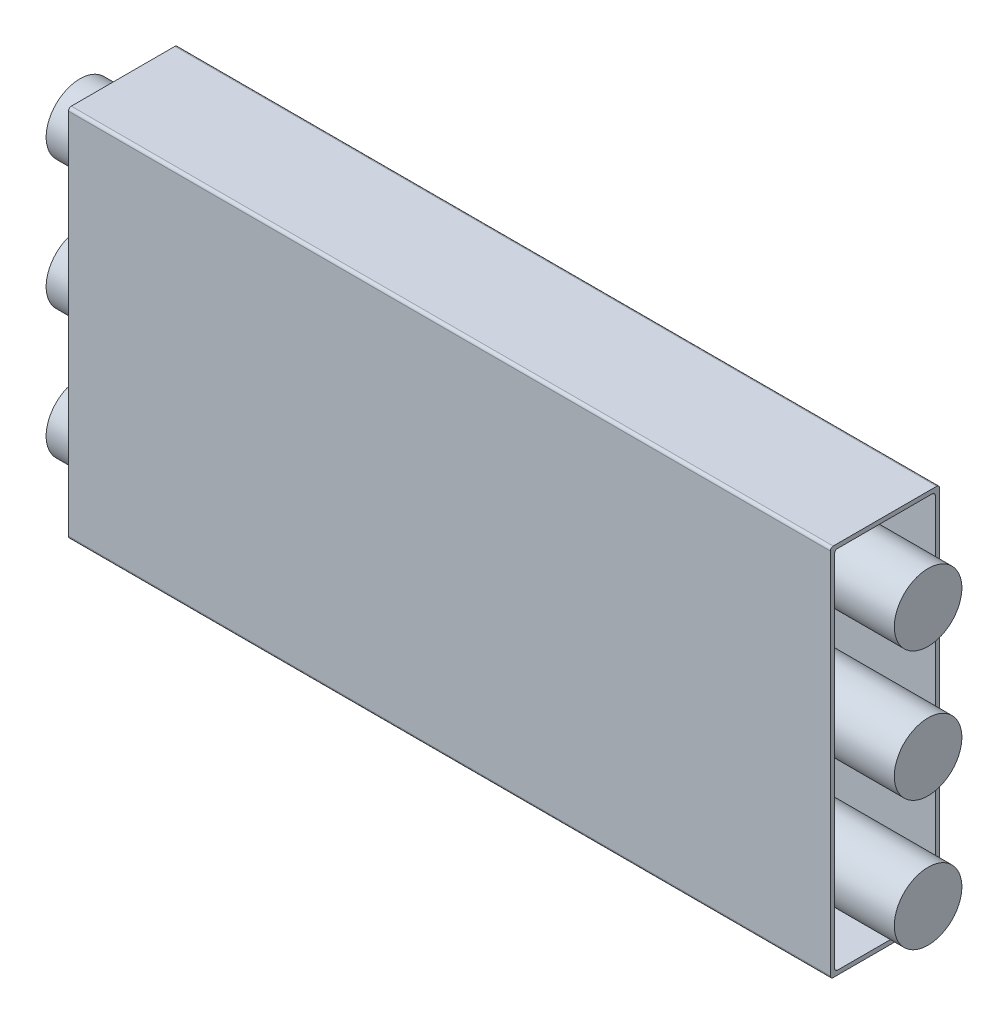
ISO-10303-21;
HEADER;
FILE_DESCRIPTION(('STEP AP214'),'2;1');
FILE_NAME('part.step','',(''),(''),'','','');
FILE_SCHEMA(('AUTOMOTIVE_DESIGN { 1 0 10303 214 1 1 1 1 }'));
ENDSEC;
DATA;
#1=APPLICATION_CONTEXT('core data for automotive mechanical design processes');
#2=APPLICATION_PROTOCOL_DEFINITION('international standard','automotive_design',2000,#1);
#3=PRODUCT_CONTEXT('',#1,'mechanical');
#4=PRODUCT('Part','Part','',(#3));
#5=PRODUCT_RELATED_PRODUCT_CATEGORY('part','',(#4));
#6=PRODUCT_DEFINITION_FORMATION('','',#4);
#7=PRODUCT_DEFINITION_CONTEXT('part definition',#1,'design');
#8=PRODUCT_DEFINITION('design','',#6,#7);
#9=PRODUCT_DEFINITION_SHAPE('','',#8);
#10=(LENGTH_UNIT() NAMED_UNIT(*) SI_UNIT(.MILLI.,.METRE.));
#11=(NAMED_UNIT(*) PLANE_ANGLE_UNIT() SI_UNIT($,.RADIAN.));
#12=(NAMED_UNIT(*) SI_UNIT($,.STERADIAN.) SOLID_ANGLE_UNIT());
#13=UNCERTAINTY_MEASURE_WITH_UNIT(LENGTH_MEASURE(1.E-05),#10,'distance_accuracy_value','');
#14=(GEOMETRIC_REPRESENTATION_CONTEXT(3) GLOBAL_UNCERTAINTY_ASSIGNED_CONTEXT((#13)) GLOBAL_UNIT_ASSIGNED_CONTEXT((#10,
#11,#12)) REPRESENTATION_CONTEXT('',''));
#15=CARTESIAN_POINT('',(0.,0.,0.));
#16=DIRECTION('',(0.,0.,1.));
#17=DIRECTION('',(1.,0.,0.));
#18=AXIS2_PLACEMENT_3D('',#15,#16,#17);
#19=CARTESIAN_POINT('',(16.5,-13.,7.6));
#20=DIRECTION('',(-1.,0.,0.));
#21=DIRECTION('',(0.,0.,1.));
#22=AXIS2_PLACEMENT_3D('',#19,#20,#21);
#23=PLANE('',#22);
#24=CARTESIAN_POINT('',(16.5,0.,3.8));
#25=DIRECTION('',(-1.,0.,0.));
#26=DIRECTION('',(0.,0.,1.));
#27=AXIS2_PLACEMENT_3D('',#24,#25,#26);
#28=CIRCLE('',#27,2.35);
#29=CARTESIAN_POINT('',(16.5,0.,6.15));
#30=VERTEX_POINT('',#29);
#31=EDGE_CURVE('E294',#30,#30,#28,.F.);
#32=ORIENTED_EDGE('',*,*,#31,.F.);
#33=EDGE_LOOP('',(#32));
#34=FACE_BOUND('',#33,.T.);
#35=DIRECTION('',(0.,0.,-1.));
#36=VECTOR('',#35,1.);
#37=CARTESIAN_POINT('',(16.5,-12.7,7.3));
#38=LINE('',#37,#36);
#39=CARTESIAN_POINT('',(16.5,-12.7,7.1));
#40=VERTEX_POINT('',#39);
#41=CARTESIAN_POINT('',(16.5,-12.7,0.499999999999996));
#42=VERTEX_POINT('',#41);
#43=EDGE_CURVE('E272',#40,#42,#38,.T.);
#44=ORIENTED_EDGE('',*,*,#43,.T.);
#45=CARTESIAN_POINT('',(16.5,-12.5,0.499999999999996));
#46=DIRECTION('',(-1.,0.,0.));
#47=DIRECTION('',(0.,0.,1.));
#48=AXIS2_PLACEMENT_3D('',#45,#46,#47);
#49=CIRCLE('',#48,0.2);
#50=CARTESIAN_POINT('',(16.5,-12.5,0.299999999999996));
#51=VERTEX_POINT('',#50);
#52=EDGE_CURVE('E319',#42,#51,#49,.F.);
#53=ORIENTED_EDGE('',*,*,#52,.T.);
#54=DIRECTION('',(0.,1.,0.));
#55=VECTOR('',#54,1.);
#56=CARTESIAN_POINT('',(16.5,12.7,0.3));
#57=LINE('',#56,#55);
#58=CARTESIAN_POINT('',(16.5,12.5,0.3));
#59=VERTEX_POINT('',#58);
#60=EDGE_CURVE('E275',#51,#59,#57,.T.);
#61=ORIENTED_EDGE('',*,*,#60,.T.);
#62=CARTESIAN_POINT('',(16.5,12.5,0.5));
#63=DIRECTION('',(-1.,0.,0.));
#64=DIRECTION('',(0.,0.,1.));
#65=AXIS2_PLACEMENT_3D('',#62,#63,#64);
#66=CIRCLE('',#65,0.2);
#67=CARTESIAN_POINT('',(16.5,12.7,0.500000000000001));
#68=VERTEX_POINT('',#67);
#69=EDGE_CURVE('E317',#59,#68,#66,.F.);
#70=ORIENTED_EDGE('',*,*,#69,.T.);
#71=DIRECTION('',(0.,0.,1.));
#72=VECTOR('',#71,1.);
#73=CARTESIAN_POINT('',(16.5,12.7,7.3));
#74=LINE('',#73,#72);
#75=CARTESIAN_POINT('',(16.5,12.7,7.1));
#76=VERTEX_POINT('',#75);
#77=EDGE_CURVE('E260',#68,#76,#74,.T.);
#78=ORIENTED_EDGE('',*,*,#77,.T.);
#79=CARTESIAN_POINT('',(16.5,12.5,7.1));
#80=DIRECTION('',(-1.,0.,0.));
#81=DIRECTION('',(0.,0.,1.));
#82=AXIS2_PLACEMENT_3D('',#79,#80,#81);
#83=CIRCLE('',#82,0.2);
#84=CARTESIAN_POINT('',(16.5,12.5,7.3));
#85=VERTEX_POINT('',#84);
#86=EDGE_CURVE('E315',#76,#85,#83,.F.);
#87=ORIENTED_EDGE('',*,*,#86,.T.);
#88=DIRECTION('',(0.,-1.,0.));
#89=VECTOR('',#88,1.);
#90=CARTESIAN_POINT('',(16.5,12.7,7.3));
#91=LINE('',#90,#89);
#92=CARTESIAN_POINT('',(16.5,-12.5,7.3));
#93=VERTEX_POINT('',#92);
#94=EDGE_CURVE('E255',#85,#93,#91,.T.);
#95=ORIENTED_EDGE('',*,*,#94,.T.);
#96=CARTESIAN_POINT('',(16.5,-12.5,7.1));
#97=DIRECTION('',(-1.,0.,0.));
#98=DIRECTION('',(0.,0.,1.));
#99=AXIS2_PLACEMENT_3D('',#96,#97,#98);
#100=CIRCLE('',#99,0.2);
#101=EDGE_CURVE('E313',#93,#40,#100,.F.);
#102=ORIENTED_EDGE('',*,*,#101,.T.);
#103=EDGE_LOOP('',(#44,#53,#61,#70,#78,#87,#95,#102));
#104=FACE_BOUND('',#103,.T.);
#105=CARTESIAN_POINT('',(16.5,9.,3.8));
#106=DIRECTION('',(-1.,0.,0.));
#107=DIRECTION('',(0.,0.,1.));
#108=AXIS2_PLACEMENT_3D('',#105,#106,#107);
#109=CIRCLE('',#108,2.35);
#110=CARTESIAN_POINT('',(16.5,9.,6.15));
#111=VERTEX_POINT('',#110);
#112=EDGE_CURVE('E291',#111,#111,#109,.F.);
#113=ORIENTED_EDGE('',*,*,#112,.F.);
#114=EDGE_LOOP('',(#113));
#115=FACE_BOUND('',#114,.T.);
#116=CARTESIAN_POINT('',(16.5,-9.,3.8));
#117=DIRECTION('',(-1.,0.,0.));
#118=DIRECTION('',(0.,0.,1.));
#119=AXIS2_PLACEMENT_3D('',#116,#117,#118);
#120=CIRCLE('',#119,2.35);
#121=CARTESIAN_POINT('',(16.5,-9.,6.15));
#122=VERTEX_POINT('',#121);
#123=EDGE_CURVE('E297',#122,#122,#120,.F.);
#124=ORIENTED_EDGE('',*,*,#123,.F.);
#125=EDGE_LOOP('',(#124));
#126=FACE_BOUND('',#125,.T.);
#127=ADVANCED_FACE('F34',(#34,#104,#115,#126),#23,.F.);
#128=CARTESIAN_POINT('',(-16.5,13.,7.6));
#129=DIRECTION('',(0.,-1.,0.));
#130=DIRECTION('',(0.,0.,-1.));
#131=AXIS2_PLACEMENT_3D('',#128,#129,#130);
#132=PLANE('',#131);
#133=DIRECTION('',(0.,0.,1.));
#134=VECTOR('',#133,1.);
#135=CARTESIAN_POINT('',(-26.5,13.,7.6));
#136=LINE('',#135,#134);
#137=CARTESIAN_POINT('',(-26.5,13.,0.200000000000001));
#138=VERTEX_POINT('',#137);
#139=CARTESIAN_POINT('',(-26.5,13.,7.4));
#140=VERTEX_POINT('',#139);
#141=EDGE_CURVE('E237',#138,#140,#136,.T.);
#142=ORIENTED_EDGE('',*,*,#141,.T.);
#143=DIRECTION('',(-1.,0.,0.));
#144=VECTOR('',#143,1.);
#145=CARTESIAN_POINT('',(-16.5,13.,7.4));
#146=LINE('',#145,#144);
#147=CARTESIAN_POINT('',(26.5,13.,7.4));
#148=VERTEX_POINT('',#147);
#149=EDGE_CURVE('E378',#140,#148,#146,.F.);
#150=ORIENTED_EDGE('',*,*,#149,.T.);
#151=DIRECTION('',(0.,0.,1.));
#152=VECTOR('',#151,1.);
#153=CARTESIAN_POINT('',(26.5,13.,7.6));
#154=LINE('',#153,#152);
#155=CARTESIAN_POINT('',(26.5,13.,0.200000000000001));
#156=VERTEX_POINT('',#155);
#157=EDGE_CURVE('E288',#156,#148,#154,.T.);
#158=ORIENTED_EDGE('',*,*,#157,.F.);
#159=DIRECTION('',(-1.,0.,0.));
#160=VECTOR('',#159,1.);
#161=CARTESIAN_POINT('',(-26.5,13.,0.2));
#162=LINE('',#161,#160);
#163=EDGE_CURVE('E375',#156,#138,#162,.T.);
#164=ORIENTED_EDGE('',*,*,#163,.T.);
#165=EDGE_LOOP('',(#142,#150,#158,#164));
#166=FACE_BOUND('',#165,.T.);
#167=ADVANCED_FACE('F452',(#166),#132,.F.);
#168=CARTESIAN_POINT('',(-16.5,-13.,7.6));
#169=DIRECTION('',(0.,1.,0.));
#170=DIRECTION('',(0.,0.,1.));
#171=AXIS2_PLACEMENT_3D('',#168,#169,#170);
#172=PLANE('',#171);
#173=DIRECTION('',(0.,0.,-1.));
#174=VECTOR('',#173,1.);
#175=CARTESIAN_POINT('',(26.5,-13.,7.6));
#176=LINE('',#175,#174);
#177=CARTESIAN_POINT('',(26.5,-13.,7.4));
#178=VERTEX_POINT('',#177);
#179=CARTESIAN_POINT('',(26.5,-13.,0.200000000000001));
#180=VERTEX_POINT('',#179);
#181=EDGE_CURVE('E282',#178,#180,#176,.T.);
#182=ORIENTED_EDGE('',*,*,#181,.F.);
#183=DIRECTION('',(1.,0.,0.));
#184=VECTOR('',#183,1.);
#185=CARTESIAN_POINT('',(-16.5,-13.,7.4));
#186=LINE('',#185,#184);
#187=CARTESIAN_POINT('',(-26.5,-13.,7.4));
#188=VERTEX_POINT('',#187);
#189=EDGE_CURVE('E363',#178,#188,#186,.F.);
#190=ORIENTED_EDGE('',*,*,#189,.T.);
#191=DIRECTION('',(0.,0.,-1.));
#192=VECTOR('',#191,1.);
#193=CARTESIAN_POINT('',(-26.5,-13.,7.6));
#194=LINE('',#193,#192);
#195=CARTESIAN_POINT('',(-26.5,-13.,0.200000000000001));
#196=VERTEX_POINT('',#195);
#197=EDGE_CURVE('E243',#188,#196,#194,.T.);
#198=ORIENTED_EDGE('',*,*,#197,.T.);
#199=DIRECTION('',(1.,0.,0.));
#200=VECTOR('',#199,1.);
#201=CARTESIAN_POINT('',(26.5,-13.,0.2));
#202=LINE('',#201,#200);
#203=EDGE_CURVE('E360',#196,#180,#202,.T.);
#204=ORIENTED_EDGE('',*,*,#203,.T.);
#205=EDGE_LOOP('',(#182,#190,#198,#204));
#206=FACE_BOUND('',#205,.T.);
#207=ADVANCED_FACE('F458',(#206),#172,.F.);
#208=CARTESIAN_POINT('',(16.5,13.,7.6));
#209=DIRECTION('',(0.,0.,-1.));
#210=DIRECTION('',(-1.,0.,0.));
#211=AXIS2_PLACEMENT_3D('',#208,#209,#210);
#212=PLANE('',#211);
#213=DIRECTION('',(0.,-1.,0.));
#214=VECTOR('',#213,1.);
#215=CARTESIAN_POINT('',(-26.5,13.,7.6));
#216=LINE('',#215,#214);
#217=CARTESIAN_POINT('',(-26.5,12.8,7.6));
#218=VERTEX_POINT('',#217);
#219=CARTESIAN_POINT('',(-26.5,-12.8,7.6));
#220=VERTEX_POINT('',#219);
#221=EDGE_CURVE('E234',#218,#220,#216,.T.);
#222=ORIENTED_EDGE('',*,*,#221,.T.);
#223=DIRECTION('',(1.,0.,0.));
#224=VECTOR('',#223,1.);
#225=CARTESIAN_POINT('',(16.5,-12.8,7.6));
#226=LINE('',#225,#224);
#227=CARTESIAN_POINT('',(26.5,-12.8,7.6));
#228=VERTEX_POINT('',#227);
#229=EDGE_CURVE('E349',#220,#228,#226,.T.);
#230=ORIENTED_EDGE('',*,*,#229,.T.);
#231=DIRECTION('',(0.,-1.,0.));
#232=VECTOR('',#231,1.);
#233=CARTESIAN_POINT('',(26.5,13.,7.6));
#234=LINE('',#233,#232);
#235=CARTESIAN_POINT('',(26.5,12.8,7.6));
#236=VERTEX_POINT('',#235);
#237=EDGE_CURVE('E269',#236,#228,#234,.T.);
#238=ORIENTED_EDGE('',*,*,#237,.F.);
#239=DIRECTION('',(-1.,0.,0.));
#240=VECTOR('',#239,1.);
#241=CARTESIAN_POINT('',(16.5,12.8,7.6));
#242=LINE('',#241,#240);
#243=EDGE_CURVE('E346',#236,#218,#242,.T.);
#244=ORIENTED_EDGE('',*,*,#243,.T.);
#245=EDGE_LOOP('',(#222,#230,#238,#244));
#246=FACE_BOUND('',#245,.T.);
#247=ADVANCED_FACE('F511',(#246),#212,.F.);
#248=CARTESIAN_POINT('',(16.5,13.,0.));
#249=DIRECTION('',(0.,0.,-1.));
#250=DIRECTION('',(-1.,0.,0.));
#251=AXIS2_PLACEMENT_3D('',#248,#249,#250);
#252=PLANE('',#251);
#253=DIRECTION('',(0.,1.,0.));
#254=VECTOR('',#253,1.);
#255=CARTESIAN_POINT('',(26.5,13.,0.));
#256=LINE('',#255,#254);
#257=CARTESIAN_POINT('',(26.5,-12.8,0.));
#258=VERTEX_POINT('',#257);
#259=CARTESIAN_POINT('',(26.5,12.8,0.));
#260=VERTEX_POINT('',#259);
#261=EDGE_CURVE('E285',#258,#260,#256,.T.);
#262=ORIENTED_EDGE('',*,*,#261,.F.);
#263=DIRECTION('',(1.,0.,0.));
#264=VECTOR('',#263,1.);
#265=CARTESIAN_POINT('',(-26.5,-12.8,0.));
#266=LINE('',#265,#264);
#267=CARTESIAN_POINT('',(-26.5,-12.8,0.));
#268=VERTEX_POINT('',#267);
#269=EDGE_CURVE('E56',#258,#268,#266,.F.);
#270=ORIENTED_EDGE('',*,*,#269,.T.);
#271=DIRECTION('',(0.,1.,0.));
#272=VECTOR('',#271,1.);
#273=CARTESIAN_POINT('',(-26.5,13.,0.));
#274=LINE('',#273,#272);
#275=CARTESIAN_POINT('',(-26.5,12.8,0.));
#276=VERTEX_POINT('',#275);
#277=EDGE_CURVE('E241',#268,#276,#274,.T.);
#278=ORIENTED_EDGE('',*,*,#277,.T.);
#279=DIRECTION('',(-1.,0.,0.));
#280=VECTOR('',#279,1.);
#281=CARTESIAN_POINT('',(26.5,12.8,0.));
#282=LINE('',#281,#280);
#283=EDGE_CURVE('E372',#276,#260,#282,.F.);
#284=ORIENTED_EDGE('',*,*,#283,.T.);
#285=EDGE_LOOP('',(#262,#270,#278,#284));
#286=FACE_BOUND('',#285,.T.);
#287=ADVANCED_FACE('F522',(#286),#252,.T.);
#288=CARTESIAN_POINT('',(26.5,-13.,7.6));
#289=DIRECTION('',(1.,0.,0.));
#290=DIRECTION('',(0.,0.,-1.));
#291=AXIS2_PLACEMENT_3D('',#288,#289,#290);
#292=PLANE('',#291);
#293=ORIENTED_EDGE('',*,*,#237,.T.);
#294=CARTESIAN_POINT('',(26.5,-12.8,7.4));
#295=DIRECTION('',(1.,0.,0.));
#296=DIRECTION('',(0.,0.,-1.));
#297=AXIS2_PLACEMENT_3D('',#294,#295,#296);
#298=CIRCLE('',#297,0.2);
#299=EDGE_CURVE('E358',#228,#178,#298,.T.);
#300=ORIENTED_EDGE('',*,*,#299,.T.);
#301=ORIENTED_EDGE('',*,*,#181,.T.);
#302=CARTESIAN_POINT('',(26.5,-12.8,0.2));
#303=DIRECTION('',(1.,0.,0.));
#304=DIRECTION('',(0.,0.,-1.));
#305=AXIS2_PLACEMENT_3D('',#302,#303,#304);
#306=CIRCLE('',#305,0.2);
#307=EDGE_CURVE('E356',#180,#258,#306,.T.);
#308=ORIENTED_EDGE('',*,*,#307,.T.);
#309=ORIENTED_EDGE('',*,*,#261,.T.);
#310=CARTESIAN_POINT('',(26.5,12.8,0.2));
#311=DIRECTION('',(1.,0.,0.));
#312=DIRECTION('',(0.,0.,-1.));
#313=AXIS2_PLACEMENT_3D('',#310,#311,#312);
#314=CIRCLE('',#313,0.2);
#315=EDGE_CURVE('E352',#260,#156,#314,.T.);
#316=ORIENTED_EDGE('',*,*,#315,.T.);
#317=ORIENTED_EDGE('',*,*,#157,.T.);
#318=CARTESIAN_POINT('',(26.5,12.8,7.4));
#319=DIRECTION('',(1.,0.,0.));
#320=DIRECTION('',(0.,0.,-1.));
#321=AXIS2_PLACEMENT_3D('',#318,#319,#320);
#322=CIRCLE('',#321,0.2);
#323=EDGE_CURVE('E354',#148,#236,#322,.T.);
#324=ORIENTED_EDGE('',*,*,#323,.T.);
#325=EDGE_LOOP('',(#293,#300,#301,#308,#309,#316,#317,#324));
#326=FACE_BOUND('',#325,.T.);
#327=DIRECTION('',(0.,0.,-1.));
#328=VECTOR('',#327,1.);
#329=CARTESIAN_POINT('',(26.5,-12.7,7.3));
#330=LINE('',#329,#328);
#331=CARTESIAN_POINT('',(26.5,-12.7,7.1));
#332=VERTEX_POINT('',#331);
#333=CARTESIAN_POINT('',(26.5,-12.7,0.499999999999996));
#334=VERTEX_POINT('',#333);
#335=EDGE_CURVE('E259',#332,#334,#330,.T.);
#336=ORIENTED_EDGE('',*,*,#335,.F.);
#337=CARTESIAN_POINT('',(26.5,-12.5,7.1));
#338=DIRECTION('',(1.,0.,0.));
#339=DIRECTION('',(0.,0.,-1.));
#340=AXIS2_PLACEMENT_3D('',#337,#338,#339);
#341=CIRCLE('',#340,0.2);
#342=CARTESIAN_POINT('',(26.5,-12.5,7.3));
#343=VERTEX_POINT('',#342);
#344=EDGE_CURVE('E388',#332,#343,#341,.F.);
#345=ORIENTED_EDGE('',*,*,#344,.T.);
#346=DIRECTION('',(0.,-1.,0.));
#347=VECTOR('',#346,1.);
#348=CARTESIAN_POINT('',(26.5,12.7,7.3));
#349=LINE('',#348,#347);
#350=CARTESIAN_POINT('',(26.5,12.5,7.3));
#351=VERTEX_POINT('',#350);
#352=EDGE_CURVE('E256',#351,#343,#349,.T.);
#353=ORIENTED_EDGE('',*,*,#352,.F.);
#354=CARTESIAN_POINT('',(26.5,12.5,7.1));
#355=DIRECTION('',(1.,0.,0.));
#356=DIRECTION('',(0.,0.,-1.));
#357=AXIS2_PLACEMENT_3D('',#354,#355,#356);
#358=CIRCLE('',#357,0.2);
#359=CARTESIAN_POINT('',(26.5,12.7,7.1));
#360=VERTEX_POINT('',#359);
#361=EDGE_CURVE('E386',#351,#360,#358,.F.);
#362=ORIENTED_EDGE('',*,*,#361,.T.);
#363=DIRECTION('',(0.,0.,1.));
#364=VECTOR('',#363,1.);
#365=CARTESIAN_POINT('',(26.5,12.7,7.3));
#366=LINE('',#365,#364);
#367=CARTESIAN_POINT('',(26.5,12.7,0.500000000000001));
#368=VERTEX_POINT('',#367);
#369=EDGE_CURVE('E266',#368,#360,#366,.T.);
#370=ORIENTED_EDGE('',*,*,#369,.F.);
#371=CARTESIAN_POINT('',(26.5,12.5,0.5));
#372=DIRECTION('',(1.,0.,0.));
#373=DIRECTION('',(0.,0.,-1.));
#374=AXIS2_PLACEMENT_3D('',#371,#372,#373);
#375=CIRCLE('',#374,0.2);
#376=CARTESIAN_POINT('',(26.5,12.5,0.3));
#377=VERTEX_POINT('',#376);
#378=EDGE_CURVE('E384',#368,#377,#375,.F.);
#379=ORIENTED_EDGE('',*,*,#378,.T.);
#380=DIRECTION('',(0.,1.,0.));
#381=VECTOR('',#380,1.);
#382=CARTESIAN_POINT('',(26.5,12.7,0.3));
#383=LINE('',#382,#381);
#384=CARTESIAN_POINT('',(26.5,-12.5,0.299999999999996));
#385=VERTEX_POINT('',#384);
#386=EDGE_CURVE('E263',#385,#377,#383,.T.);
#387=ORIENTED_EDGE('',*,*,#386,.F.);
#388=CARTESIAN_POINT('',(26.5,-12.5,0.499999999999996));
#389=DIRECTION('',(1.,0.,0.));
#390=DIRECTION('',(0.,0.,-1.));
#391=AXIS2_PLACEMENT_3D('',#388,#389,#390);
#392=CIRCLE('',#391,0.2);
#393=EDGE_CURVE('E382',#385,#334,#392,.F.);
#394=ORIENTED_EDGE('',*,*,#393,.T.);
#395=EDGE_LOOP('',(#336,#345,#353,#362,#370,#379,#387,#394));
#396=FACE_BOUND('',#395,.T.);
#397=ADVANCED_FACE('F507',(#326,#396),#292,.T.);
#398=CARTESIAN_POINT('',(26.5,12.7,7.3));
#399=DIRECTION('',(0.,0.,-1.));
#400=DIRECTION('',(0.,1.,0.));
#401=AXIS2_PLACEMENT_3D('',#398,#399,#400);
#402=PLANE('',#401);
#403=ORIENTED_EDGE('',*,*,#94,.F.);
#404=DIRECTION('',(-1.,0.,0.));
#405=VECTOR('',#404,1.);
#406=CARTESIAN_POINT('',(26.5,12.5,7.3));
#407=LINE('',#406,#405);
#408=EDGE_CURVE('E334',#85,#351,#407,.F.);
#409=ORIENTED_EDGE('',*,*,#408,.T.);
#410=ORIENTED_EDGE('',*,*,#352,.T.);
#411=DIRECTION('',(-1.,0.,0.));
#412=VECTOR('',#411,1.);
#413=CARTESIAN_POINT('',(16.5,-12.5,7.3));
#414=LINE('',#413,#412);
#415=EDGE_CURVE('E331',#343,#93,#414,.T.);
#416=ORIENTED_EDGE('',*,*,#415,.T.);
#417=EDGE_LOOP('',(#403,#409,#410,#416));
#418=FACE_BOUND('',#417,.T.);
#419=ADVANCED_FACE('F568',(#418),#402,.T.);
#420=CARTESIAN_POINT('',(26.5,-12.7,7.3));
#421=DIRECTION('',(0.,1.,0.));
#422=DIRECTION('',(0.,0.,1.));
#423=AXIS2_PLACEMENT_3D('',#420,#421,#422);
#424=PLANE('',#423);
#425=ORIENTED_EDGE('',*,*,#335,.T.);
#426=DIRECTION('',(-1.,0.,0.));
#427=VECTOR('',#426,1.);
#428=CARTESIAN_POINT('',(16.5,-12.7,0.499999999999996));
#429=LINE('',#428,#427);
#430=EDGE_CURVE('E310',#334,#42,#429,.T.);
#431=ORIENTED_EDGE('',*,*,#430,.T.);
#432=ORIENTED_EDGE('',*,*,#43,.F.);
#433=DIRECTION('',(-1.,0.,0.));
#434=VECTOR('',#433,1.);
#435=CARTESIAN_POINT('',(26.5,-12.7,7.1));
#436=LINE('',#435,#434);
#437=EDGE_CURVE('E308',#40,#332,#436,.F.);
#438=ORIENTED_EDGE('',*,*,#437,.T.);
#439=EDGE_LOOP('',(#425,#431,#432,#438));
#440=FACE_BOUND('',#439,.T.);
#441=ADVANCED_FACE('F564',(#440),#424,.T.);
#442=CARTESIAN_POINT('',(26.5,12.7,0.3));
#443=DIRECTION('',(0.,0.,1.));
#444=DIRECTION('',(0.,-1.,0.));
#445=AXIS2_PLACEMENT_3D('',#442,#443,#444);
#446=PLANE('',#445);
#447=ORIENTED_EDGE('',*,*,#60,.F.);
#448=DIRECTION('',(-1.,0.,0.));
#449=VECTOR('',#448,1.);
#450=CARTESIAN_POINT('',(26.5,-12.5,0.299999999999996));
#451=LINE('',#450,#449);
#452=EDGE_CURVE('E324',#51,#385,#451,.F.);
#453=ORIENTED_EDGE('',*,*,#452,.T.);
#454=ORIENTED_EDGE('',*,*,#386,.T.);
#455=DIRECTION('',(-1.,0.,0.));
#456=VECTOR('',#455,1.);
#457=CARTESIAN_POINT('',(16.5,12.5,0.3));
#458=LINE('',#457,#456);
#459=EDGE_CURVE('E321',#377,#59,#458,.T.);
#460=ORIENTED_EDGE('',*,*,#459,.T.);
#461=EDGE_LOOP('',(#447,#453,#454,#460));
#462=FACE_BOUND('',#461,.T.);
#463=ADVANCED_FACE('F560',(#462),#446,.T.);
#464=CARTESIAN_POINT('',(26.5,12.7,7.3));
#465=DIRECTION('',(0.,-1.,0.));
#466=DIRECTION('',(0.,0.,-1.));
#467=AXIS2_PLACEMENT_3D('',#464,#465,#466);
#468=PLANE('',#467);
#469=ORIENTED_EDGE('',*,*,#77,.F.);
#470=DIRECTION('',(-1.,0.,0.));
#471=VECTOR('',#470,1.);
#472=CARTESIAN_POINT('',(26.5,12.7,0.5));
#473=LINE('',#472,#471);
#474=EDGE_CURVE('E329',#68,#368,#473,.F.);
#475=ORIENTED_EDGE('',*,*,#474,.T.);
#476=ORIENTED_EDGE('',*,*,#369,.T.);
#477=DIRECTION('',(-1.,0.,0.));
#478=VECTOR('',#477,1.);
#479=CARTESIAN_POINT('',(16.5,12.7,7.1));
#480=LINE('',#479,#478);
#481=EDGE_CURVE('E326',#360,#76,#480,.T.);
#482=ORIENTED_EDGE('',*,*,#481,.T.);
#483=EDGE_LOOP('',(#469,#475,#476,#482));
#484=FACE_BOUND('',#483,.T.);
#485=ADVANCED_FACE('F556',(#484),#468,.T.);
#486=CARTESIAN_POINT('',(29.5,9.,3.8));
#487=DIRECTION('',(-1.,0.,0.));
#488=DIRECTION('',(0.,0.,1.));
#489=AXIS2_PLACEMENT_3D('',#486,#487,#488);
#490=CYLINDRICAL_SURFACE('',#489,2.35);
#491=CARTESIAN_POINT('',(29.5,9.,3.8));
#492=DIRECTION('',(1.,0.,0.));
#493=DIRECTION('',(0.,0.,-1.));
#494=AXIS2_PLACEMENT_3D('',#491,#492,#493);
#495=CIRCLE('',#494,2.35);
#496=CARTESIAN_POINT('',(29.5,9.,6.15));
#497=VERTEX_POINT('',#496);
#498=EDGE_CURVE('E252',#497,#497,#495,.T.);
#499=CARTESIAN_POINT('',(29.5,9.,6.15));
#500=CARTESIAN_POINT('',(29.3645833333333,9.,6.15));
#501=CARTESIAN_POINT('',(29.2291666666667,9.,6.15));
#502=CARTESIAN_POINT('',(28.9583333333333,9.,6.15));
#503=CARTESIAN_POINT('',(28.8229166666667,9.,6.15));
#504=CARTESIAN_POINT('',(28.5520833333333,9.,6.15));
#505=CARTESIAN_POINT('',(28.4166666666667,9.,6.15));
#506=CARTESIAN_POINT('',(28.1458333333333,9.,6.15));
#507=CARTESIAN_POINT('',(28.0104166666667,9.,6.15));
#508=CARTESIAN_POINT('',(27.7395833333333,9.,6.15));
#509=CARTESIAN_POINT('',(27.6041666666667,9.,6.15));
#510=CARTESIAN_POINT('',(27.3333333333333,9.,6.15));
#511=CARTESIAN_POINT('',(27.1979166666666,9.,6.15));
#512=CARTESIAN_POINT('',(26.9270833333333,9.,6.15));
#513=CARTESIAN_POINT('',(26.7916666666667,9.,6.15));
#514=CARTESIAN_POINT('',(26.5208333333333,9.,6.15));
#515=CARTESIAN_POINT('',(26.3854166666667,9.,6.15));
#516=CARTESIAN_POINT('',(26.1145833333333,9.,6.15));
#517=CARTESIAN_POINT('',(25.9791666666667,9.,6.15));
#518=CARTESIAN_POINT('',(25.7083333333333,9.,6.15));
#519=CARTESIAN_POINT('',(25.5729166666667,9.,6.15));
#520=CARTESIAN_POINT('',(25.3020833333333,9.,6.15));
#521=CARTESIAN_POINT('',(25.1666666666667,9.,6.15));
#522=CARTESIAN_POINT('',(24.8958333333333,9.,6.15));
#523=CARTESIAN_POINT('',(24.7604166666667,9.,6.15));
#524=CARTESIAN_POINT('',(24.4895833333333,9.,6.15));
#525=CARTESIAN_POINT('',(24.3541666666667,9.,6.15));
#526=CARTESIAN_POINT('',(24.0833333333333,9.,6.15));
#527=CARTESIAN_POINT('',(23.9479166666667,9.,6.15));
#528=CARTESIAN_POINT('',(23.6770833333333,9.,6.15));
#529=CARTESIAN_POINT('',(23.5416666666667,9.,6.15));
#530=CARTESIAN_POINT('',(23.2708333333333,9.,6.15));
#531=CARTESIAN_POINT('',(23.1354166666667,9.,6.15));
#532=CARTESIAN_POINT('',(22.8645833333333,9.,6.15));
#533=CARTESIAN_POINT('',(22.7291666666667,9.,6.15));
#534=CARTESIAN_POINT('',(22.4583333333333,9.,6.15));
#535=CARTESIAN_POINT('',(22.3229166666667,9.,6.15));
#536=CARTESIAN_POINT('',(22.0520833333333,9.,6.15));
#537=CARTESIAN_POINT('',(21.9166666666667,9.,6.15));
#538=CARTESIAN_POINT('',(21.6458333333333,9.,6.15));
#539=CARTESIAN_POINT('',(21.5104166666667,9.,6.15));
#540=CARTESIAN_POINT('',(21.2395833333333,9.,6.15));
#541=CARTESIAN_POINT('',(21.1041666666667,9.,6.15));
#542=CARTESIAN_POINT('',(20.8333333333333,9.,6.15));
#543=CARTESIAN_POINT('',(20.6979166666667,9.,6.15));
#544=CARTESIAN_POINT('',(20.4270833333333,9.,6.15));
#545=CARTESIAN_POINT('',(20.2916666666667,9.,6.15));
#546=CARTESIAN_POINT('',(20.0208333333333,9.,6.15));
#547=CARTESIAN_POINT('',(19.8854166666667,9.,6.15));
#548=CARTESIAN_POINT('',(19.6145833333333,9.,6.15));
#549=CARTESIAN_POINT('',(19.4791666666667,9.,6.15));
#550=CARTESIAN_POINT('',(19.2083333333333,9.,6.15));
#551=CARTESIAN_POINT('',(19.0729166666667,9.,6.15));
#552=CARTESIAN_POINT('',(18.8020833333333,9.,6.15));
#553=CARTESIAN_POINT('',(18.6666666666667,9.,6.15));
#554=CARTESIAN_POINT('',(18.3958333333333,9.,6.15));
#555=CARTESIAN_POINT('',(18.2604166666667,9.,6.15));
#556=CARTESIAN_POINT('',(17.9895833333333,9.,6.15));
#557=CARTESIAN_POINT('',(17.8541666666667,9.,6.15));
#558=CARTESIAN_POINT('',(17.5833333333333,9.,6.15));
#559=CARTESIAN_POINT('',(17.4479166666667,9.,6.15));
#560=CARTESIAN_POINT('',(17.1770833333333,9.,6.15));
#561=CARTESIAN_POINT('',(17.0416666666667,9.,6.15));
#562=CARTESIAN_POINT('',(16.7708333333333,9.,6.15));
#563=CARTESIAN_POINT('',(16.6354166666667,9.,6.15));
#564=CARTESIAN_POINT('',(16.5,9.,6.15));
#565=B_SPLINE_CURVE_WITH_KNOTS('',3,(#499,#500,#501,#502,#503,#504,#505,#506,#507,#508,#509,
#510,#511,#512,#513,#514,#515,#516,#517,#518,#519,#520,#521,#522,#523,#524,#525,#526,#527,#528,
#529,#530,#531,#532,#533,#534,#535,#536,#537,#538,#539,#540,#541,#542,#543,#544,#545,#546,#547,
#548,#549,#550,#551,#552,#553,#554,#555,#556,#557,#558,#559,#560,#561,#562,#563,#564),
.UNSPECIFIED.,.F.,.F.,(4,2,2,2,2,2,2,2,2,2,2,2,2,2,2,2,2,2,2,2,2,2,2,2,2,2,2,2,2,2,2,2,4),(0.,
0.406249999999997,0.812499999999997,1.21875,1.625,2.03125,2.4375,2.84375,3.25,3.65625,4.0625,
4.46875,4.87499999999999,5.28125,5.68749999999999,6.09374999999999,6.5,6.90625,7.3125,
7.71874999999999,8.12499999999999,8.53124999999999,8.93749999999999,9.34374999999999,
9.74999999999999,10.15625,10.5625,10.96875,11.375,11.78125,12.1875,12.59375,13.),.UNSPECIFIED.);
#566=EDGE_CURVE('BSEAM552',#497,#111,#565,.T.);
#567=ORIENTED_EDGE('',*,*,#498,.F.);
#568=ORIENTED_EDGE('',*,*,#112,.T.);
#569=ORIENTED_EDGE('',*,*,#566,.T.);
#570=ORIENTED_EDGE('',*,*,#566,.F.);
#571=EDGE_LOOP('',(#567,#569,#568,#570));
#572=FACE_BOUND('',#571,.T.);
#573=ADVANCED_FACE('F552',(#572),#490,.T.);
#574=CARTESIAN_POINT('',(29.5,9.,3.8));
#575=DIRECTION('',(1.,0.,0.));
#576=DIRECTION('',(0.,0.,-1.));
#577=AXIS2_PLACEMENT_3D('',#574,#575,#576);
#578=PLANE('',#577);
#579=ORIENTED_EDGE('',*,*,#498,.T.);
#580=EDGE_LOOP('',(#579));
#581=FACE_BOUND('',#580,.T.);
#582=ADVANCED_FACE('F548',(#581),#578,.T.);
#583=CARTESIAN_POINT('',(29.5,0.,3.8));
#584=DIRECTION('',(-1.,0.,0.));
#585=DIRECTION('',(0.,0.,1.));
#586=AXIS2_PLACEMENT_3D('',#583,#584,#585);
#587=CYLINDRICAL_SURFACE('',#586,2.35);
#588=CARTESIAN_POINT('',(29.5,0.,3.8));
#589=DIRECTION('',(1.,0.,0.));
#590=DIRECTION('',(0.,0.,-1.));
#591=AXIS2_PLACEMENT_3D('',#588,#589,#590);
#592=CIRCLE('',#591,2.35);
#593=CARTESIAN_POINT('',(29.5,0.,6.15));
#594=VERTEX_POINT('',#593);
#595=EDGE_CURVE('E249',#594,#594,#592,.T.);
#596=CARTESIAN_POINT('',(29.5,0.,6.15));
#597=CARTESIAN_POINT('',(29.3645833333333,0.,6.15));
#598=CARTESIAN_POINT('',(29.2291666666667,0.,6.15));
#599=CARTESIAN_POINT('',(28.9583333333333,0.,6.15));
#600=CARTESIAN_POINT('',(28.8229166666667,0.,6.15));
#601=CARTESIAN_POINT('',(28.5520833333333,0.,6.15));
#602=CARTESIAN_POINT('',(28.4166666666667,0.,6.15));
#603=CARTESIAN_POINT('',(28.1458333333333,0.,6.15));
#604=CARTESIAN_POINT('',(28.0104166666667,0.,6.15));
#605=CARTESIAN_POINT('',(27.7395833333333,0.,6.15));
#606=CARTESIAN_POINT('',(27.6041666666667,0.,6.15));
#607=CARTESIAN_POINT('',(27.3333333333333,0.,6.15));
#608=CARTESIAN_POINT('',(27.1979166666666,0.,6.15));
#609=CARTESIAN_POINT('',(26.9270833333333,0.,6.15));
#610=CARTESIAN_POINT('',(26.7916666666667,0.,6.15));
#611=CARTESIAN_POINT('',(26.5208333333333,0.,6.15));
#612=CARTESIAN_POINT('',(26.3854166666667,0.,6.15));
#613=CARTESIAN_POINT('',(26.1145833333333,0.,6.15));
#614=CARTESIAN_POINT('',(25.9791666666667,0.,6.15));
#615=CARTESIAN_POINT('',(25.7083333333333,0.,6.15));
#616=CARTESIAN_POINT('',(25.5729166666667,0.,6.15));
#617=CARTESIAN_POINT('',(25.3020833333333,0.,6.15));
#618=CARTESIAN_POINT('',(25.1666666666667,0.,6.15));
#619=CARTESIAN_POINT('',(24.8958333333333,0.,6.15));
#620=CARTESIAN_POINT('',(24.7604166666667,0.,6.15));
#621=CARTESIAN_POINT('',(24.4895833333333,0.,6.15));
#622=CARTESIAN_POINT('',(24.3541666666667,0.,6.15));
#623=CARTESIAN_POINT('',(24.0833333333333,0.,6.15));
#624=CARTESIAN_POINT('',(23.9479166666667,0.,6.15));
#625=CARTESIAN_POINT('',(23.6770833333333,0.,6.15));
#626=CARTESIAN_POINT('',(23.5416666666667,0.,6.15));
#627=CARTESIAN_POINT('',(23.2708333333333,0.,6.15));
#628=CARTESIAN_POINT('',(23.1354166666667,0.,6.15));
#629=CARTESIAN_POINT('',(22.8645833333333,0.,6.15));
#630=CARTESIAN_POINT('',(22.7291666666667,0.,6.15));
#631=CARTESIAN_POINT('',(22.4583333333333,0.,6.15));
#632=CARTESIAN_POINT('',(22.3229166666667,0.,6.15));
#633=CARTESIAN_POINT('',(22.0520833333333,0.,6.15));
#634=CARTESIAN_POINT('',(21.9166666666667,0.,6.15));
#635=CARTESIAN_POINT('',(21.6458333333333,0.,6.15));
#636=CARTESIAN_POINT('',(21.5104166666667,0.,6.15));
#637=CARTESIAN_POINT('',(21.2395833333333,0.,6.15));
#638=CARTESIAN_POINT('',(21.1041666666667,0.,6.15));
#639=CARTESIAN_POINT('',(20.8333333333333,0.,6.15));
#640=CARTESIAN_POINT('',(20.6979166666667,0.,6.15));
#641=CARTESIAN_POINT('',(20.4270833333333,0.,6.15));
#642=CARTESIAN_POINT('',(20.2916666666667,0.,6.15));
#643=CARTESIAN_POINT('',(20.0208333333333,0.,6.15));
#644=CARTESIAN_POINT('',(19.8854166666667,0.,6.15));
#645=CARTESIAN_POINT('',(19.6145833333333,0.,6.15));
#646=CARTESIAN_POINT('',(19.4791666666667,0.,6.15));
#647=CARTESIAN_POINT('',(19.2083333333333,0.,6.15));
#648=CARTESIAN_POINT('',(19.0729166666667,0.,6.15));
#649=CARTESIAN_POINT('',(18.8020833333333,0.,6.15));
#650=CARTESIAN_POINT('',(18.6666666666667,0.,6.15));
#651=CARTESIAN_POINT('',(18.3958333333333,0.,6.15));
#652=CARTESIAN_POINT('',(18.2604166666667,0.,6.15));
#653=CARTESIAN_POINT('',(17.9895833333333,0.,6.15));
#654=CARTESIAN_POINT('',(17.8541666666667,0.,6.15));
#655=CARTESIAN_POINT('',(17.5833333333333,0.,6.15));
#656=CARTESIAN_POINT('',(17.4479166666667,0.,6.15));
#657=CARTESIAN_POINT('',(17.1770833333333,0.,6.15));
#658=CARTESIAN_POINT('',(17.0416666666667,0.,6.15));
#659=CARTESIAN_POINT('',(16.7708333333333,0.,6.15));
#660=CARTESIAN_POINT('',(16.6354166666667,0.,6.15));
#661=CARTESIAN_POINT('',(16.5,0.,6.15));
#662=B_SPLINE_CURVE_WITH_KNOTS('',3,(#596,#597,#598,#599,#600,#601,#602,#603,#604,#605,#606,
#607,#608,#609,#610,#611,#612,#613,#614,#615,#616,#617,#618,#619,#620,#621,#622,#623,#624,#625,
#626,#627,#628,#629,#630,#631,#632,#633,#634,#635,#636,#637,#638,#639,#640,#641,#642,#643,#644,
#645,#646,#647,#648,#649,#650,#651,#652,#653,#654,#655,#656,#657,#658,#659,#660,#661),
.UNSPECIFIED.,.F.,.F.,(4,2,2,2,2,2,2,2,2,2,2,2,2,2,2,2,2,2,2,2,2,2,2,2,2,2,2,2,2,2,2,2,4),(0.,
0.406249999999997,0.812499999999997,1.21875,1.625,2.03125,2.4375,2.84375,3.25,3.65625,4.0625,
4.46875,4.87499999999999,5.28125,5.68749999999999,6.09374999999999,6.5,6.90625,7.3125,
7.71874999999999,8.12499999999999,8.53124999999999,8.93749999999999,9.34374999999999,
9.74999999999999,10.15625,10.5625,10.96875,11.375,11.78125,12.1875,12.59375,13.),.UNSPECIFIED.);
#663=EDGE_CURVE('BSEAM544',#594,#30,#662,.T.);
#664=ORIENTED_EDGE('',*,*,#595,.F.);
#665=ORIENTED_EDGE('',*,*,#31,.T.);
#666=ORIENTED_EDGE('',*,*,#663,.T.);
#667=ORIENTED_EDGE('',*,*,#663,.F.);
#668=EDGE_LOOP('',(#664,#666,#665,#667));
#669=FACE_BOUND('',#668,.T.);
#670=ADVANCED_FACE('F544',(#669),#587,.T.);
#671=CARTESIAN_POINT('',(29.5,0.,3.8));
#672=DIRECTION('',(1.,0.,0.));
#673=DIRECTION('',(0.,0.,-1.));
#674=AXIS2_PLACEMENT_3D('',#671,#672,#673);
#675=PLANE('',#674);
#676=ORIENTED_EDGE('',*,*,#595,.T.);
#677=EDGE_LOOP('',(#676));
#678=FACE_BOUND('',#677,.T.);
#679=ADVANCED_FACE('F540',(#678),#675,.T.);
#680=CARTESIAN_POINT('',(29.5,-9.,3.8));
#681=DIRECTION('',(-1.,0.,0.));
#682=DIRECTION('',(0.,0.,1.));
#683=AXIS2_PLACEMENT_3D('',#680,#681,#682);
#684=CYLINDRICAL_SURFACE('',#683,2.35);
#685=CARTESIAN_POINT('',(29.5,-9.,3.8));
#686=DIRECTION('',(1.,0.,0.));
#687=DIRECTION('',(0.,0.,-1.));
#688=AXIS2_PLACEMENT_3D('',#685,#686,#687);
#689=CIRCLE('',#688,2.35);
#690=CARTESIAN_POINT('',(29.5,-9.,6.15));
#691=VERTEX_POINT('',#690);
#692=EDGE_CURVE('E246',#691,#691,#689,.T.);
#693=CARTESIAN_POINT('',(29.5,-9.,6.15));
#694=CARTESIAN_POINT('',(29.3645833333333,-9.,6.15));
#695=CARTESIAN_POINT('',(29.2291666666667,-9.,6.15));
#696=CARTESIAN_POINT('',(28.9583333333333,-9.,6.15));
#697=CARTESIAN_POINT('',(28.8229166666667,-9.,6.15));
#698=CARTESIAN_POINT('',(28.5520833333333,-9.,6.15));
#699=CARTESIAN_POINT('',(28.4166666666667,-9.,6.15));
#700=CARTESIAN_POINT('',(28.1458333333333,-9.,6.15));
#701=CARTESIAN_POINT('',(28.0104166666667,-9.,6.15));
#702=CARTESIAN_POINT('',(27.7395833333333,-9.,6.15));
#703=CARTESIAN_POINT('',(27.6041666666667,-9.,6.15));
#704=CARTESIAN_POINT('',(27.3333333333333,-9.,6.15));
#705=CARTESIAN_POINT('',(27.1979166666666,-9.,6.15));
#706=CARTESIAN_POINT('',(26.9270833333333,-9.,6.15));
#707=CARTESIAN_POINT('',(26.7916666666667,-9.,6.15));
#708=CARTESIAN_POINT('',(26.5208333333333,-9.,6.15));
#709=CARTESIAN_POINT('',(26.3854166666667,-9.,6.15));
#710=CARTESIAN_POINT('',(26.1145833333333,-9.,6.15));
#711=CARTESIAN_POINT('',(25.9791666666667,-9.,6.15));
#712=CARTESIAN_POINT('',(25.7083333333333,-9.,6.15));
#713=CARTESIAN_POINT('',(25.5729166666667,-9.,6.15));
#714=CARTESIAN_POINT('',(25.3020833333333,-9.,6.15));
#715=CARTESIAN_POINT('',(25.1666666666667,-9.,6.15));
#716=CARTESIAN_POINT('',(24.8958333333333,-9.,6.15));
#717=CARTESIAN_POINT('',(24.7604166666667,-9.,6.15));
#718=CARTESIAN_POINT('',(24.4895833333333,-9.,6.15));
#719=CARTESIAN_POINT('',(24.3541666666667,-9.,6.15));
#720=CARTESIAN_POINT('',(24.0833333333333,-9.,6.15));
#721=CARTESIAN_POINT('',(23.9479166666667,-9.,6.15));
#722=CARTESIAN_POINT('',(23.6770833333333,-9.,6.15));
#723=CARTESIAN_POINT('',(23.5416666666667,-9.,6.15));
#724=CARTESIAN_POINT('',(23.2708333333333,-9.,6.15));
#725=CARTESIAN_POINT('',(23.1354166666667,-9.,6.15));
#726=CARTESIAN_POINT('',(22.8645833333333,-9.,6.15));
#727=CARTESIAN_POINT('',(22.7291666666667,-9.,6.15));
#728=CARTESIAN_POINT('',(22.4583333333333,-9.,6.15));
#729=CARTESIAN_POINT('',(22.3229166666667,-9.,6.15));
#730=CARTESIAN_POINT('',(22.0520833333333,-9.,6.15));
#731=CARTESIAN_POINT('',(21.9166666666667,-9.,6.15));
#732=CARTESIAN_POINT('',(21.6458333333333,-9.,6.15));
#733=CARTESIAN_POINT('',(21.5104166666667,-9.,6.15));
#734=CARTESIAN_POINT('',(21.2395833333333,-9.,6.15));
#735=CARTESIAN_POINT('',(21.1041666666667,-9.,6.15));
#736=CARTESIAN_POINT('',(20.8333333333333,-9.,6.15));
#737=CARTESIAN_POINT('',(20.6979166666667,-9.,6.15));
#738=CARTESIAN_POINT('',(20.4270833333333,-9.,6.15));
#739=CARTESIAN_POINT('',(20.2916666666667,-9.,6.15));
#740=CARTESIAN_POINT('',(20.0208333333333,-9.,6.15));
#741=CARTESIAN_POINT('',(19.8854166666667,-9.,6.15));
#742=CARTESIAN_POINT('',(19.6145833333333,-9.,6.15));
#743=CARTESIAN_POINT('',(19.4791666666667,-9.,6.15));
#744=CARTESIAN_POINT('',(19.2083333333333,-9.,6.15));
#745=CARTESIAN_POINT('',(19.0729166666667,-9.,6.15));
#746=CARTESIAN_POINT('',(18.8020833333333,-9.,6.15));
#747=CARTESIAN_POINT('',(18.6666666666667,-9.,6.15));
#748=CARTESIAN_POINT('',(18.3958333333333,-9.,6.15));
#749=CARTESIAN_POINT('',(18.2604166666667,-9.,6.15));
#750=CARTESIAN_POINT('',(17.9895833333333,-9.,6.15));
#751=CARTESIAN_POINT('',(17.8541666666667,-9.,6.15));
#752=CARTESIAN_POINT('',(17.5833333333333,-9.,6.15));
#753=CARTESIAN_POINT('',(17.4479166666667,-9.,6.15));
#754=CARTESIAN_POINT('',(17.1770833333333,-9.,6.15));
#755=CARTESIAN_POINT('',(17.0416666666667,-9.,6.15));
#756=CARTESIAN_POINT('',(16.7708333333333,-9.,6.15));
#757=CARTESIAN_POINT('',(16.6354166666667,-9.,6.15));
#758=CARTESIAN_POINT('',(16.5,-9.,6.15));
#759=B_SPLINE_CURVE_WITH_KNOTS('',3,(#693,#694,#695,#696,#697,#698,#699,#700,#701,#702,#703,
#704,#705,#706,#707,#708,#709,#710,#711,#712,#713,#714,#715,#716,#717,#718,#719,#720,#721,#722,
#723,#724,#725,#726,#727,#728,#729,#730,#731,#732,#733,#734,#735,#736,#737,#738,#739,#740,#741,
#742,#743,#744,#745,#746,#747,#748,#749,#750,#751,#752,#753,#754,#755,#756,#757,#758),
.UNSPECIFIED.,.F.,.F.,(4,2,2,2,2,2,2,2,2,2,2,2,2,2,2,2,2,2,2,2,2,2,2,2,2,2,2,2,2,2,2,2,4),(0.,
0.406249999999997,0.812499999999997,1.21875,1.625,2.03125,2.4375,2.84375,3.25,3.65625,4.0625,
4.46875,4.87499999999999,5.28125,5.68749999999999,6.09374999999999,6.5,6.90625,7.3125,
7.71874999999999,8.12499999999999,8.53124999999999,8.93749999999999,9.34374999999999,
9.74999999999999,10.15625,10.5625,10.96875,11.375,11.78125,12.1875,12.59375,13.),.UNSPECIFIED.);
#760=EDGE_CURVE('BSEAM533',#691,#122,#759,.T.);
#761=ORIENTED_EDGE('',*,*,#692,.F.);
#762=ORIENTED_EDGE('',*,*,#123,.T.);
#763=ORIENTED_EDGE('',*,*,#760,.T.);
#764=ORIENTED_EDGE('',*,*,#760,.F.);
#765=EDGE_LOOP('',(#761,#763,#762,#764));
#766=FACE_BOUND('',#765,.T.);
#767=ADVANCED_FACE('F533',(#766),#684,.T.);
#768=CARTESIAN_POINT('',(29.5,-9.,3.8));
#769=DIRECTION('',(1.,0.,0.));
#770=DIRECTION('',(0.,0.,-1.));
#771=AXIS2_PLACEMENT_3D('',#768,#769,#770);
#772=PLANE('',#771);
#773=ORIENTED_EDGE('',*,*,#692,.T.);
#774=EDGE_LOOP('',(#773));
#775=FACE_BOUND('',#774,.T.);
#776=ADVANCED_FACE('F526',(#775),#772,.T.);
#777=CARTESIAN_POINT('',(-26.5,-13.,7.6));
#778=DIRECTION('',(-1.,0.,0.));
#779=DIRECTION('',(0.,0.,-1.));
#780=AXIS2_PLACEMENT_3D('',#777,#778,#779);
#781=PLANE('',#780);
#782=DIRECTION('',(0.,0.,1.));
#783=VECTOR('',#782,1.);
#784=CARTESIAN_POINT('',(-26.5,12.7,7.3));
#785=LINE('',#784,#783);
#786=CARTESIAN_POINT('',(-26.5,12.7,0.500000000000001));
#787=VERTEX_POINT('',#786);
#788=CARTESIAN_POINT('',(-26.5,12.7,7.1));
#789=VERTEX_POINT('',#788);
#790=EDGE_CURVE('E215',#787,#789,#785,.T.);
#791=ORIENTED_EDGE('',*,*,#790,.T.);
#792=CARTESIAN_POINT('',(-26.5,12.5,7.1));
#793=DIRECTION('',(-1.,0.,0.));
#794=DIRECTION('',(0.,0.,1.));
#795=AXIS2_PLACEMENT_3D('',#792,#793,#794);
#796=CIRCLE('',#795,0.2);
#797=CARTESIAN_POINT('',(-26.5,12.5,7.3));
#798=VERTEX_POINT('',#797);
#799=EDGE_CURVE('E390',#789,#798,#796,.F.);
#800=ORIENTED_EDGE('',*,*,#799,.T.);
#801=DIRECTION('',(0.,-1.,0.));
#802=VECTOR('',#801,1.);
#803=CARTESIAN_POINT('',(-26.5,12.7,7.3));
#804=LINE('',#803,#802);
#805=CARTESIAN_POINT('',(-26.5,-12.5,7.3));
#806=VERTEX_POINT('',#805);
#807=EDGE_CURVE('E233',#798,#806,#804,.T.);
#808=ORIENTED_EDGE('',*,*,#807,.T.);
#809=CARTESIAN_POINT('',(-26.5,-12.5,7.1));
#810=DIRECTION('',(-1.,0.,0.));
#811=DIRECTION('',(0.,0.,1.));
#812=AXIS2_PLACEMENT_3D('',#809,#810,#811);
#813=CIRCLE('',#812,0.2);
#814=CARTESIAN_POINT('',(-26.5,-12.7,7.1));
#815=VERTEX_POINT('',#814);
#816=EDGE_CURVE('E42',#806,#815,#813,.F.);
#817=ORIENTED_EDGE('',*,*,#816,.T.);
#818=DIRECTION('',(0.,0.,-1.));
#819=VECTOR('',#818,1.);
#820=CARTESIAN_POINT('',(-26.5,-12.7,7.3));
#821=LINE('',#820,#819);
#822=CARTESIAN_POINT('',(-26.5,-12.7,0.499999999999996));
#823=VERTEX_POINT('',#822);
#824=EDGE_CURVE('E238',#815,#823,#821,.T.);
#825=ORIENTED_EDGE('',*,*,#824,.T.);
#826=CARTESIAN_POINT('',(-26.5,-12.5,0.499999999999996));
#827=DIRECTION('',(-1.,0.,0.));
#828=DIRECTION('',(0.,0.,1.));
#829=AXIS2_PLACEMENT_3D('',#826,#827,#828);
#830=CIRCLE('',#829,0.2);
#831=CARTESIAN_POINT('',(-26.5,-12.5,0.299999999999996));
#832=VERTEX_POINT('',#831);
#833=EDGE_CURVE('E11',#823,#832,#830,.F.);
#834=ORIENTED_EDGE('',*,*,#833,.T.);
#835=DIRECTION('',(0.,1.,0.));
#836=VECTOR('',#835,1.);
#837=CARTESIAN_POINT('',(-26.5,12.7,0.3));
#838=LINE('',#837,#836);
#839=CARTESIAN_POINT('',(-26.5,12.5,0.3));
#840=VERTEX_POINT('',#839);
#841=EDGE_CURVE('E406',#832,#840,#838,.T.);
#842=ORIENTED_EDGE('',*,*,#841,.T.);
#843=CARTESIAN_POINT('',(-26.5,12.5,0.5));
#844=DIRECTION('',(-1.,0.,0.));
#845=DIRECTION('',(0.,0.,1.));
#846=AXIS2_PLACEMENT_3D('',#843,#844,#845);
#847=CIRCLE('',#846,0.2);
#848=EDGE_CURVE('E380',#840,#787,#847,.F.);
#849=ORIENTED_EDGE('',*,*,#848,.T.);
#850=EDGE_LOOP('',(#791,#800,#808,#817,#825,#834,#842,#849));
#851=FACE_BOUND('',#850,.T.);
#852=ORIENTED_EDGE('',*,*,#197,.F.);
#853=CARTESIAN_POINT('',(-26.5,-12.8,7.4));
#854=DIRECTION('',(-1.,0.,0.));
#855=DIRECTION('',(0.,0.,1.));
#856=AXIS2_PLACEMENT_3D('',#853,#854,#855);
#857=CIRCLE('',#856,0.2);
#858=EDGE_CURVE('E370',#188,#220,#857,.T.);
#859=ORIENTED_EDGE('',*,*,#858,.T.);
#860=ORIENTED_EDGE('',*,*,#221,.F.);
#861=CARTESIAN_POINT('',(-26.5,12.8,7.4));
#862=DIRECTION('',(-1.,0.,0.));
#863=DIRECTION('',(0.,0.,1.));
#864=AXIS2_PLACEMENT_3D('',#861,#862,#863);
#865=CIRCLE('',#864,0.2);
#866=EDGE_CURVE('E366',#218,#140,#865,.T.);
#867=ORIENTED_EDGE('',*,*,#866,.T.);
#868=ORIENTED_EDGE('',*,*,#141,.F.);
#869=CARTESIAN_POINT('',(-26.5,12.8,0.2));
#870=DIRECTION('',(-1.,0.,0.));
#871=DIRECTION('',(0.,0.,1.));
#872=AXIS2_PLACEMENT_3D('',#869,#870,#871);
#873=CIRCLE('',#872,0.2);
#874=EDGE_CURVE('E49',#138,#276,#873,.T.);
#875=ORIENTED_EDGE('',*,*,#874,.T.);
#876=ORIENTED_EDGE('',*,*,#277,.F.);
#877=CARTESIAN_POINT('',(-26.5,-12.8,0.2));
#878=DIRECTION('',(-1.,0.,0.));
#879=DIRECTION('',(0.,0.,1.));
#880=AXIS2_PLACEMENT_3D('',#877,#878,#879);
#881=CIRCLE('',#880,0.2);
#882=EDGE_CURVE('E368',#268,#196,#881,.T.);
#883=ORIENTED_EDGE('',*,*,#882,.T.);
#884=EDGE_LOOP('',(#852,#859,#860,#867,#868,#875,#876,#883));
#885=FACE_BOUND('',#884,.T.);
#886=ADVANCED_FACE('F396',(#851,#885),#781,.T.);
#887=CARTESIAN_POINT('',(-26.5,12.7,7.3));
#888=DIRECTION('',(0.,0.,1.));
#889=DIRECTION('',(0.,-1.,0.));
#890=AXIS2_PLACEMENT_3D('',#887,#888,#889);
#891=PLANE('',#890);
#892=ORIENTED_EDGE('',*,*,#807,.F.);
#893=DIRECTION('',(1.,0.,0.));
#894=VECTOR('',#893,1.);
#895=CARTESIAN_POINT('',(-16.5,12.5,7.3));
#896=LINE('',#895,#894);
#897=CARTESIAN_POINT('',(-16.5,12.5,7.3));
#898=VERTEX_POINT('',#897);
#899=EDGE_CURVE('E338',#798,#898,#896,.T.);
#900=ORIENTED_EDGE('',*,*,#899,.T.);
#901=DIRECTION('',(0.,-1.,0.));
#902=VECTOR('',#901,1.);
#903=CARTESIAN_POINT('',(-16.5,12.7,7.3));
#904=LINE('',#903,#902);
#905=CARTESIAN_POINT('',(-16.5,-12.5,7.3));
#906=VERTEX_POINT('',#905);
#907=EDGE_CURVE('E222',#898,#906,#904,.T.);
#908=ORIENTED_EDGE('',*,*,#907,.T.);
#909=DIRECTION('',(1.,0.,0.));
#910=VECTOR('',#909,1.);
#911=CARTESIAN_POINT('',(-26.5,-12.5,7.3));
#912=LINE('',#911,#910);
#913=EDGE_CURVE('E336',#906,#806,#912,.F.);
#914=ORIENTED_EDGE('',*,*,#913,.T.);
#915=EDGE_LOOP('',(#892,#900,#908,#914));
#916=FACE_BOUND('',#915,.T.);
#917=ADVANCED_FACE('F409',(#916),#891,.F.);
#918=CARTESIAN_POINT('',(-26.5,12.7,7.3));
#919=DIRECTION('',(0.,1.,0.));
#920=DIRECTION('',(0.,0.,1.));
#921=AXIS2_PLACEMENT_3D('',#918,#919,#920);
#922=PLANE('',#921);
#923=ORIENTED_EDGE('',*,*,#790,.F.);
#924=DIRECTION('',(1.,0.,0.));
#925=VECTOR('',#924,1.);
#926=CARTESIAN_POINT('',(-16.5,12.7,0.5));
#927=LINE('',#926,#925);
#928=CARTESIAN_POINT('',(-16.5,12.7,0.500000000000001));
#929=VERTEX_POINT('',#928);
#930=EDGE_CURVE('E199',#787,#929,#927,.T.);
#931=ORIENTED_EDGE('',*,*,#930,.T.);
#932=DIRECTION('',(0.,0.,1.));
#933=VECTOR('',#932,1.);
#934=CARTESIAN_POINT('',(-16.5,12.7,7.3));
#935=LINE('',#934,#933);
#936=CARTESIAN_POINT('',(-16.5,12.7,7.1));
#937=VERTEX_POINT('',#936);
#938=EDGE_CURVE('E212',#929,#937,#935,.T.);
#939=ORIENTED_EDGE('',*,*,#938,.T.);
#940=DIRECTION('',(1.,0.,0.));
#941=VECTOR('',#940,1.);
#942=CARTESIAN_POINT('',(-26.5,12.7,7.1));
#943=LINE('',#942,#941);
#944=EDGE_CURVE('E217',#937,#789,#943,.F.);
#945=ORIENTED_EDGE('',*,*,#944,.T.);
#946=EDGE_LOOP('',(#923,#931,#939,#945));
#947=FACE_BOUND('',#946,.T.);
#948=ADVANCED_FACE('F211',(#947),#922,.F.);
#949=CARTESIAN_POINT('',(-26.5,12.7,0.3));
#950=DIRECTION('',(0.,0.,-1.));
#951=DIRECTION('',(0.,1.,0.));
#952=AXIS2_PLACEMENT_3D('',#949,#950,#951);
#953=PLANE('',#952);
#954=DIRECTION('',(0.,1.,0.));
#955=VECTOR('',#954,1.);
#956=CARTESIAN_POINT('',(-16.5,12.7,0.3));
#957=LINE('',#956,#955);
#958=CARTESIAN_POINT('',(-16.5,-12.5,0.299999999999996));
#959=VERTEX_POINT('',#958);
#960=CARTESIAN_POINT('',(-16.5,12.5,0.3));
#961=VERTEX_POINT('',#960);
#962=EDGE_CURVE('E221',#959,#961,#957,.T.);
#963=ORIENTED_EDGE('',*,*,#962,.T.);
#964=DIRECTION('',(1.,0.,0.));
#965=VECTOR('',#964,1.);
#966=CARTESIAN_POINT('',(-26.5,12.5,0.3));
#967=LINE('',#966,#965);
#968=EDGE_CURVE('E200',#961,#840,#967,.F.);
#969=ORIENTED_EDGE('',*,*,#968,.T.);
#970=ORIENTED_EDGE('',*,*,#841,.F.);
#971=DIRECTION('',(1.,0.,0.));
#972=VECTOR('',#971,1.);
#973=CARTESIAN_POINT('',(-16.5,-12.5,0.299999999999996));
#974=LINE('',#973,#972);
#975=EDGE_CURVE('E205',#832,#959,#974,.T.);
#976=ORIENTED_EDGE('',*,*,#975,.T.);
#977=EDGE_LOOP('',(#963,#969,#970,#976));
#978=FACE_BOUND('',#977,.T.);
#979=ADVANCED_FACE('F590',(#978),#953,.F.);
#980=CARTESIAN_POINT('',(-26.5,-12.7,7.3));
#981=DIRECTION('',(0.,-1.,0.));
#982=DIRECTION('',(0.,0.,-1.));
#983=AXIS2_PLACEMENT_3D('',#980,#981,#982);
#984=PLANE('',#983);
#985=ORIENTED_EDGE('',*,*,#824,.F.);
#986=DIRECTION('',(1.,0.,0.));
#987=VECTOR('',#986,1.);
#988=CARTESIAN_POINT('',(-16.5,-12.7,7.1));
#989=LINE('',#988,#987);
#990=CARTESIAN_POINT('',(-16.5,-12.7,7.1));
#991=VERTEX_POINT('',#990);
#992=EDGE_CURVE('E343',#815,#991,#989,.T.);
#993=ORIENTED_EDGE('',*,*,#992,.T.);
#994=DIRECTION('',(0.,0.,-1.));
#995=VECTOR('',#994,1.);
#996=CARTESIAN_POINT('',(-16.5,-12.7,7.3));
#997=LINE('',#996,#995);
#998=CARTESIAN_POINT('',(-16.5,-12.7,0.499999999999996));
#999=VERTEX_POINT('',#998);
#1000=EDGE_CURVE('E224',#991,#999,#997,.T.);
#1001=ORIENTED_EDGE('',*,*,#1000,.T.);
#1002=DIRECTION('',(1.,0.,0.));
#1003=VECTOR('',#1002,1.);
#1004=CARTESIAN_POINT('',(-26.5,-12.7,0.499999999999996));
#1005=LINE('',#1004,#1003);
#1006=EDGE_CURVE('E341',#999,#823,#1005,.F.);
#1007=ORIENTED_EDGE('',*,*,#1006,.T.);
#1008=EDGE_LOOP('',(#985,#993,#1001,#1007));
#1009=FACE_BOUND('',#1008,.T.);
#1010=ADVANCED_FACE('F403',(#1009),#984,.F.);
#1011=CARTESIAN_POINT('',(-16.5,-13.,7.6));
#1012=DIRECTION('',(1.,0.,0.));
#1013=DIRECTION('',(0.,0.,-1.));
#1014=AXIS2_PLACEMENT_3D('',#1011,#1012,#1013);
#1015=PLANE('',#1014);
#1016=CARTESIAN_POINT('',(-16.5,-9.,3.8));
#1017=DIRECTION('',(1.,0.,0.));
#1018=DIRECTION('',(0.,0.,-1.));
#1019=AXIS2_PLACEMENT_3D('',#1016,#1017,#1018);
#1020=CIRCLE('',#1019,2.35);
#1021=CARTESIAN_POINT('',(-16.5,-9.,1.45));
#1022=VERTEX_POINT('',#1021);
#1023=EDGE_CURVE('E431',#1022,#1022,#1020,.T.);
#1024=ORIENTED_EDGE('',*,*,#1023,.T.);
#1025=EDGE_LOOP('',(#1024));
#1026=FACE_BOUND('',#1025,.T.);
#1027=CARTESIAN_POINT('',(-16.5,0.,3.8));
#1028=DIRECTION('',(1.,0.,0.));
#1029=DIRECTION('',(0.,0.,-1.));
#1030=AXIS2_PLACEMENT_3D('',#1027,#1028,#1029);
#1031=CIRCLE('',#1030,2.35);
#1032=CARTESIAN_POINT('',(-16.5,0.,1.45));
#1033=VERTEX_POINT('',#1032);
#1034=EDGE_CURVE('E425',#1033,#1033,#1031,.T.);
#1035=ORIENTED_EDGE('',*,*,#1034,.T.);
#1036=EDGE_LOOP('',(#1035));
#1037=FACE_BOUND('',#1036,.T.);
#1038=CARTESIAN_POINT('',(-16.5,9.,3.8));
#1039=DIRECTION('',(1.,0.,0.));
#1040=DIRECTION('',(0.,0.,-1.));
#1041=AXIS2_PLACEMENT_3D('',#1038,#1039,#1040);
#1042=CIRCLE('',#1041,2.35);
#1043=CARTESIAN_POINT('',(-16.5,9.,1.45));
#1044=VERTEX_POINT('',#1043);
#1045=EDGE_CURVE('E419',#1044,#1044,#1042,.T.);
#1046=ORIENTED_EDGE('',*,*,#1045,.T.);
#1047=EDGE_LOOP('',(#1046));
#1048=FACE_BOUND('',#1047,.T.);
#1049=ORIENTED_EDGE('',*,*,#938,.F.);
#1050=CARTESIAN_POINT('',(-16.5,12.5,0.5));
#1051=DIRECTION('',(1.,0.,0.));
#1052=DIRECTION('',(0.,0.,-1.));
#1053=AXIS2_PLACEMENT_3D('',#1050,#1051,#1052);
#1054=CIRCLE('',#1053,0.2);
#1055=EDGE_CURVE('E195',#929,#961,#1054,.F.);
#1056=ORIENTED_EDGE('',*,*,#1055,.T.);
#1057=ORIENTED_EDGE('',*,*,#962,.F.);
#1058=CARTESIAN_POINT('',(-16.5,-12.5,0.499999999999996));
#1059=DIRECTION('',(1.,0.,0.));
#1060=DIRECTION('',(0.,0.,-1.));
#1061=AXIS2_PLACEMENT_3D('',#1058,#1059,#1060);
#1062=CIRCLE('',#1061,0.2);
#1063=EDGE_CURVE('E216',#959,#999,#1062,.F.);
#1064=ORIENTED_EDGE('',*,*,#1063,.T.);
#1065=ORIENTED_EDGE('',*,*,#1000,.F.);
#1066=CARTESIAN_POINT('',(-16.5,-12.5,7.1));
#1067=DIRECTION('',(1.,0.,0.));
#1068=DIRECTION('',(0.,0.,-1.));
#1069=AXIS2_PLACEMENT_3D('',#1066,#1067,#1068);
#1070=CIRCLE('',#1069,0.2);
#1071=EDGE_CURVE('E302',#991,#906,#1070,.F.);
#1072=ORIENTED_EDGE('',*,*,#1071,.T.);
#1073=ORIENTED_EDGE('',*,*,#907,.F.);
#1074=CARTESIAN_POINT('',(-16.5,12.5,7.1));
#1075=DIRECTION('',(1.,0.,0.));
#1076=DIRECTION('',(0.,0.,-1.));
#1077=AXIS2_PLACEMENT_3D('',#1074,#1075,#1076);
#1078=CIRCLE('',#1077,0.2);
#1079=EDGE_CURVE('E206',#898,#937,#1078,.F.);
#1080=ORIENTED_EDGE('',*,*,#1079,.T.);
#1081=EDGE_LOOP('',(#1049,#1056,#1057,#1064,#1065,#1072,#1073,#1080));
#1082=FACE_BOUND('',#1081,.T.);
#1083=ADVANCED_FACE('F219',(#1026,#1037,#1048,#1082),#1015,.F.);
#1084=CARTESIAN_POINT('',(-29.5,9.,3.8));
#1085=DIRECTION('',(1.,0.,0.));
#1086=DIRECTION('',(0.,0.,-1.));
#1087=AXIS2_PLACEMENT_3D('',#1084,#1085,#1086);
#1088=CYLINDRICAL_SURFACE('',#1087,2.35);
#1089=CARTESIAN_POINT('',(-29.5,9.,3.8));
#1090=DIRECTION('',(1.,0.,0.));
#1091=DIRECTION('',(0.,0.,-1.));
#1092=AXIS2_PLACEMENT_3D('',#1089,#1090,#1091);
#1093=CIRCLE('',#1092,2.35);
#1094=CARTESIAN_POINT('',(-29.5,9.,1.45));
#1095=VERTEX_POINT('',#1094);
#1096=EDGE_CURVE('E227',#1095,#1095,#1093,.T.);
#1097=CARTESIAN_POINT('',(-29.5,9.,1.45));
#1098=CARTESIAN_POINT('',(-29.3645833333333,9.,1.45));
#1099=CARTESIAN_POINT('',(-29.2291666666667,9.,1.45));
#1100=CARTESIAN_POINT('',(-28.9583333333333,9.,1.45));
#1101=CARTESIAN_POINT('',(-28.8229166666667,9.,1.45));
#1102=CARTESIAN_POINT('',(-28.5520833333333,9.,1.45));
#1103=CARTESIAN_POINT('',(-28.4166666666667,9.,1.45));
#1104=CARTESIAN_POINT('',(-28.1458333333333,9.,1.45));
#1105=CARTESIAN_POINT('',(-28.0104166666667,9.,1.45));
#1106=CARTESIAN_POINT('',(-27.7395833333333,9.,1.45));
#1107=CARTESIAN_POINT('',(-27.6041666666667,9.,1.45));
#1108=CARTESIAN_POINT('',(-27.3333333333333,9.,1.45));
#1109=CARTESIAN_POINT('',(-27.1979166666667,9.,1.45));
#1110=CARTESIAN_POINT('',(-26.9270833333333,9.,1.45));
#1111=CARTESIAN_POINT('',(-26.7916666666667,9.,1.45));
#1112=CARTESIAN_POINT('',(-26.5208333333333,9.,1.45));
#1113=CARTESIAN_POINT('',(-26.3854166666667,9.,1.45));
#1114=CARTESIAN_POINT('',(-26.1145833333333,9.,1.45));
#1115=CARTESIAN_POINT('',(-25.9791666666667,9.,1.45));
#1116=CARTESIAN_POINT('',(-25.7083333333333,9.,1.45));
#1117=CARTESIAN_POINT('',(-25.5729166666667,9.,1.45));
#1118=CARTESIAN_POINT('',(-25.3020833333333,9.,1.45));
#1119=CARTESIAN_POINT('',(-25.1666666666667,9.,1.45));
#1120=CARTESIAN_POINT('',(-24.8958333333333,9.,1.45));
#1121=CARTESIAN_POINT('',(-24.7604166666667,9.,1.45));
#1122=CARTESIAN_POINT('',(-24.4895833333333,9.,1.45));
#1123=CARTESIAN_POINT('',(-24.3541666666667,9.,1.45));
#1124=CARTESIAN_POINT('',(-24.0833333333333,9.,1.45));
#1125=CARTESIAN_POINT('',(-23.9479166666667,9.,1.45));
#1126=CARTESIAN_POINT('',(-23.6770833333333,9.,1.45));
#1127=CARTESIAN_POINT('',(-23.5416666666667,9.,1.45));
#1128=CARTESIAN_POINT('',(-23.2708333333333,9.,1.45));
#1129=CARTESIAN_POINT('',(-23.1354166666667,9.,1.45));
#1130=CARTESIAN_POINT('',(-22.8645833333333,9.,1.45));
#1131=CARTESIAN_POINT('',(-22.7291666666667,9.,1.45));
#1132=CARTESIAN_POINT('',(-22.4583333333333,9.,1.45));
#1133=CARTESIAN_POINT('',(-22.3229166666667,9.,1.45));
#1134=CARTESIAN_POINT('',(-22.0520833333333,9.,1.45));
#1135=CARTESIAN_POINT('',(-21.9166666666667,9.,1.45));
#1136=CARTESIAN_POINT('',(-21.6458333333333,9.,1.45));
#1137=CARTESIAN_POINT('',(-21.5104166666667,9.,1.45));
#1138=CARTESIAN_POINT('',(-21.2395833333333,9.,1.45));
#1139=CARTESIAN_POINT('',(-21.1041666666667,9.,1.45));
#1140=CARTESIAN_POINT('',(-20.8333333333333,9.,1.45));
#1141=CARTESIAN_POINT('',(-20.6979166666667,9.,1.45));
#1142=CARTESIAN_POINT('',(-20.4270833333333,9.,1.45));
#1143=CARTESIAN_POINT('',(-20.2916666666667,9.,1.45));
#1144=CARTESIAN_POINT('',(-20.0208333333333,9.,1.45));
#1145=CARTESIAN_POINT('',(-19.8854166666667,9.,1.45));
#1146=CARTESIAN_POINT('',(-19.6145833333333,9.,1.45));
#1147=CARTESIAN_POINT('',(-19.4791666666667,9.,1.45));
#1148=CARTESIAN_POINT('',(-19.2083333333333,9.,1.45));
#1149=CARTESIAN_POINT('',(-19.0729166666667,9.,1.45));
#1150=CARTESIAN_POINT('',(-18.8020833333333,9.,1.45));
#1151=CARTESIAN_POINT('',(-18.6666666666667,9.,1.45));
#1152=CARTESIAN_POINT('',(-18.3958333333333,9.,1.45));
#1153=CARTESIAN_POINT('',(-18.2604166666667,9.,1.45));
#1154=CARTESIAN_POINT('',(-17.9895833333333,9.,1.45));
#1155=CARTESIAN_POINT('',(-17.8541666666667,9.,1.45));
#1156=CARTESIAN_POINT('',(-17.5833333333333,9.,1.45));
#1157=CARTESIAN_POINT('',(-17.4479166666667,9.,1.45));
#1158=CARTESIAN_POINT('',(-17.1770833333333,9.,1.45));
#1159=CARTESIAN_POINT('',(-17.0416666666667,9.,1.45));
#1160=CARTESIAN_POINT('',(-16.7708333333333,9.,1.45));
#1161=CARTESIAN_POINT('',(-16.6354166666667,9.,1.45));
#1162=CARTESIAN_POINT('',(-16.5,9.,1.45));
#1163=B_SPLINE_CURVE_WITH_KNOTS('',3,(#1097,#1098,#1099,#1100,#1101,#1102,#1103,#1104,#1105,
#1106,#1107,#1108,#1109,#1110,#1111,#1112,#1113,#1114,#1115,#1116,#1117,#1118,#1119,#1120,#1121,
#1122,#1123,#1124,#1125,#1126,#1127,#1128,#1129,#1130,#1131,#1132,#1133,#1134,#1135,#1136,#1137,
#1138,#1139,#1140,#1141,#1142,#1143,#1144,#1145,#1146,#1147,#1148,#1149,#1150,#1151,#1152,#1153,
#1154,#1155,#1156,#1157,#1158,#1159,#1160,#1161,#1162),.UNSPECIFIED.,.F.,.F.,(4,2,2,2,2,2,2,2,2,
2,2,2,2,2,2,2,2,2,2,2,2,2,2,2,2,2,2,2,2,2,2,2,4),(0.,0.406249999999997,0.812499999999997,
1.21875,1.625,2.03125,2.4375,2.84375,3.25,3.65625,4.0625,4.46875,4.875,5.28125,5.6875,
6.09374999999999,6.5,6.90625,7.3125,7.71875,8.125,8.53125,8.93749999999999,9.34375,
9.74999999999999,10.15625,10.5625,10.96875,11.375,11.78125,12.1875,12.59375,13.),.UNSPECIFIED.);
#1164=EDGE_CURVE('BSEAM581',#1095,#1044,#1163,.T.);
#1165=ORIENTED_EDGE('',*,*,#1096,.T.);
#1166=ORIENTED_EDGE('',*,*,#1045,.F.);
#1167=ORIENTED_EDGE('',*,*,#1164,.T.);
#1168=ORIENTED_EDGE('',*,*,#1164,.F.);
#1169=EDGE_LOOP('',(#1165,#1167,#1166,#1168));
#1170=FACE_BOUND('',#1169,.T.);
#1171=ADVANCED_FACE('F581',(#1170),#1088,.T.);
#1172=CARTESIAN_POINT('',(-29.5,9.,3.8));
#1173=DIRECTION('',(-1.,0.,0.));
#1174=DIRECTION('',(0.,0.,-1.));
#1175=AXIS2_PLACEMENT_3D('',#1172,#1173,#1174);
#1176=PLANE('',#1175);
#1177=ORIENTED_EDGE('',*,*,#1096,.F.);
#1178=EDGE_LOOP('',(#1177));
#1179=FACE_BOUND('',#1178,.T.);
#1180=ADVANCED_FACE('F587',(#1179),#1176,.T.);
#1181=CARTESIAN_POINT('',(-29.5,0.,3.8));
#1182=DIRECTION('',(1.,0.,0.));
#1183=DIRECTION('',(0.,0.,-1.));
#1184=AXIS2_PLACEMENT_3D('',#1181,#1182,#1183);
#1185=CYLINDRICAL_SURFACE('',#1184,2.35);
#1186=CARTESIAN_POINT('',(-29.5,0.,3.8));
#1187=DIRECTION('',(1.,0.,0.));
#1188=DIRECTION('',(0.,0.,-1.));
#1189=AXIS2_PLACEMENT_3D('',#1186,#1187,#1188);
#1190=CIRCLE('',#1189,2.35);
#1191=CARTESIAN_POINT('',(-29.5,0.,1.45));
#1192=VERTEX_POINT('',#1191);
#1193=EDGE_CURVE('E422',#1192,#1192,#1190,.T.);
#1194=CARTESIAN_POINT('',(-29.5,0.,1.45));
#1195=CARTESIAN_POINT('',(-29.3645833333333,0.,1.45));
#1196=CARTESIAN_POINT('',(-29.2291666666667,0.,1.45));
#1197=CARTESIAN_POINT('',(-28.9583333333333,0.,1.45));
#1198=CARTESIAN_POINT('',(-28.8229166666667,0.,1.45));
#1199=CARTESIAN_POINT('',(-28.5520833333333,0.,1.45));
#1200=CARTESIAN_POINT('',(-28.4166666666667,0.,1.45));
#1201=CARTESIAN_POINT('',(-28.1458333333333,0.,1.45));
#1202=CARTESIAN_POINT('',(-28.0104166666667,0.,1.45));
#1203=CARTESIAN_POINT('',(-27.7395833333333,0.,1.45));
#1204=CARTESIAN_POINT('',(-27.6041666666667,0.,1.45));
#1205=CARTESIAN_POINT('',(-27.3333333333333,0.,1.45));
#1206=CARTESIAN_POINT('',(-27.1979166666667,0.,1.45));
#1207=CARTESIAN_POINT('',(-26.9270833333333,0.,1.45));
#1208=CARTESIAN_POINT('',(-26.7916666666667,0.,1.45));
#1209=CARTESIAN_POINT('',(-26.5208333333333,0.,1.45));
#1210=CARTESIAN_POINT('',(-26.3854166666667,0.,1.45));
#1211=CARTESIAN_POINT('',(-26.1145833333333,0.,1.45));
#1212=CARTESIAN_POINT('',(-25.9791666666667,0.,1.45));
#1213=CARTESIAN_POINT('',(-25.7083333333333,0.,1.45));
#1214=CARTESIAN_POINT('',(-25.5729166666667,0.,1.45));
#1215=CARTESIAN_POINT('',(-25.3020833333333,0.,1.45));
#1216=CARTESIAN_POINT('',(-25.1666666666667,0.,1.45));
#1217=CARTESIAN_POINT('',(-24.8958333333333,0.,1.45));
#1218=CARTESIAN_POINT('',(-24.7604166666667,0.,1.45));
#1219=CARTESIAN_POINT('',(-24.4895833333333,0.,1.45));
#1220=CARTESIAN_POINT('',(-24.3541666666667,0.,1.45));
#1221=CARTESIAN_POINT('',(-24.0833333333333,0.,1.45));
#1222=CARTESIAN_POINT('',(-23.9479166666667,0.,1.45));
#1223=CARTESIAN_POINT('',(-23.6770833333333,0.,1.45));
#1224=CARTESIAN_POINT('',(-23.5416666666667,0.,1.45));
#1225=CARTESIAN_POINT('',(-23.2708333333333,0.,1.45));
#1226=CARTESIAN_POINT('',(-23.1354166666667,0.,1.45));
#1227=CARTESIAN_POINT('',(-22.8645833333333,0.,1.45));
#1228=CARTESIAN_POINT('',(-22.7291666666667,0.,1.45));
#1229=CARTESIAN_POINT('',(-22.4583333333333,0.,1.45));
#1230=CARTESIAN_POINT('',(-22.3229166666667,0.,1.45));
#1231=CARTESIAN_POINT('',(-22.0520833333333,0.,1.45));
#1232=CARTESIAN_POINT('',(-21.9166666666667,0.,1.45));
#1233=CARTESIAN_POINT('',(-21.6458333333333,0.,1.45));
#1234=CARTESIAN_POINT('',(-21.5104166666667,0.,1.45));
#1235=CARTESIAN_POINT('',(-21.2395833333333,0.,1.45));
#1236=CARTESIAN_POINT('',(-21.1041666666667,0.,1.45));
#1237=CARTESIAN_POINT('',(-20.8333333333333,0.,1.45));
#1238=CARTESIAN_POINT('',(-20.6979166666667,0.,1.45));
#1239=CARTESIAN_POINT('',(-20.4270833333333,0.,1.45));
#1240=CARTESIAN_POINT('',(-20.2916666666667,0.,1.45));
#1241=CARTESIAN_POINT('',(-20.0208333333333,0.,1.45));
#1242=CARTESIAN_POINT('',(-19.8854166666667,0.,1.45));
#1243=CARTESIAN_POINT('',(-19.6145833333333,0.,1.45));
#1244=CARTESIAN_POINT('',(-19.4791666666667,0.,1.45));
#1245=CARTESIAN_POINT('',(-19.2083333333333,0.,1.45));
#1246=CARTESIAN_POINT('',(-19.0729166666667,0.,1.45));
#1247=CARTESIAN_POINT('',(-18.8020833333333,0.,1.45));
#1248=CARTESIAN_POINT('',(-18.6666666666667,0.,1.45));
#1249=CARTESIAN_POINT('',(-18.3958333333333,0.,1.45));
#1250=CARTESIAN_POINT('',(-18.2604166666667,0.,1.45));
#1251=CARTESIAN_POINT('',(-17.9895833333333,0.,1.45));
#1252=CARTESIAN_POINT('',(-17.8541666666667,0.,1.45));
#1253=CARTESIAN_POINT('',(-17.5833333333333,0.,1.45));
#1254=CARTESIAN_POINT('',(-17.4479166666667,0.,1.45));
#1255=CARTESIAN_POINT('',(-17.1770833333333,0.,1.45));
#1256=CARTESIAN_POINT('',(-17.0416666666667,0.,1.45));
#1257=CARTESIAN_POINT('',(-16.7708333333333,0.,1.45));
#1258=CARTESIAN_POINT('',(-16.6354166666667,0.,1.45));
#1259=CARTESIAN_POINT('',(-16.5,0.,1.45));
#1260=B_SPLINE_CURVE_WITH_KNOTS('',3,(#1194,#1195,#1196,#1197,#1198,#1199,#1200,#1201,#1202,
#1203,#1204,#1205,#1206,#1207,#1208,#1209,#1210,#1211,#1212,#1213,#1214,#1215,#1216,#1217,#1218,
#1219,#1220,#1221,#1222,#1223,#1224,#1225,#1226,#1227,#1228,#1229,#1230,#1231,#1232,#1233,#1234,
#1235,#1236,#1237,#1238,#1239,#1240,#1241,#1242,#1243,#1244,#1245,#1246,#1247,#1248,#1249,#1250,
#1251,#1252,#1253,#1254,#1255,#1256,#1257,#1258,#1259),.UNSPECIFIED.,.F.,.F.,(4,2,2,2,2,2,2,2,2,
2,2,2,2,2,2,2,2,2,2,2,2,2,2,2,2,2,2,2,2,2,2,2,4),(0.,0.406249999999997,0.812499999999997,
1.21875,1.625,2.03125,2.4375,2.84375,3.25,3.65625,4.0625,4.46875,4.875,5.28125,5.6875,
6.09374999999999,6.5,6.90625,7.3125,7.71875,8.125,8.53125,8.93749999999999,9.34375,
9.74999999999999,10.15625,10.5625,10.96875,11.375,11.78125,12.1875,12.59375,13.),.UNSPECIFIED.);
#1261=EDGE_CURVE('BSEAM599',#1192,#1033,#1260,.T.);
#1262=ORIENTED_EDGE('',*,*,#1193,.T.);
#1263=ORIENTED_EDGE('',*,*,#1034,.F.);
#1264=ORIENTED_EDGE('',*,*,#1261,.T.);
#1265=ORIENTED_EDGE('',*,*,#1261,.F.);
#1266=EDGE_LOOP('',(#1262,#1264,#1263,#1265));
#1267=FACE_BOUND('',#1266,.T.);
#1268=ADVANCED_FACE('F599',(#1267),#1185,.T.);
#1269=CARTESIAN_POINT('',(-29.5,0.,3.8));
#1270=DIRECTION('',(-1.,0.,0.));
#1271=DIRECTION('',(0.,0.,-1.));
#1272=AXIS2_PLACEMENT_3D('',#1269,#1270,#1271);
#1273=PLANE('',#1272);
#1274=ORIENTED_EDGE('',*,*,#1193,.F.);
#1275=EDGE_LOOP('',(#1274));
#1276=FACE_BOUND('',#1275,.T.);
#1277=ADVANCED_FACE('F449',(#1276),#1273,.T.);
#1278=CARTESIAN_POINT('',(-29.5,-9.,3.8));
#1279=DIRECTION('',(1.,0.,0.));
#1280=DIRECTION('',(0.,0.,-1.));
#1281=AXIS2_PLACEMENT_3D('',#1278,#1279,#1280);
#1282=CYLINDRICAL_SURFACE('',#1281,2.35);
#1283=CARTESIAN_POINT('',(-29.5,-9.,3.8));
#1284=DIRECTION('',(1.,0.,0.));
#1285=DIRECTION('',(0.,0.,-1.));
#1286=AXIS2_PLACEMENT_3D('',#1283,#1284,#1285);
#1287=CIRCLE('',#1286,2.35);
#1288=CARTESIAN_POINT('',(-29.5,-9.,1.45));
#1289=VERTEX_POINT('',#1288);
#1290=EDGE_CURVE('E428',#1289,#1289,#1287,.T.);
#1291=CARTESIAN_POINT('',(-29.5,-9.,1.45));
#1292=CARTESIAN_POINT('',(-29.3645833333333,-9.,1.45));
#1293=CARTESIAN_POINT('',(-29.2291666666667,-9.,1.45));
#1294=CARTESIAN_POINT('',(-28.9583333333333,-9.,1.45));
#1295=CARTESIAN_POINT('',(-28.8229166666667,-9.,1.45));
#1296=CARTESIAN_POINT('',(-28.5520833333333,-9.,1.45));
#1297=CARTESIAN_POINT('',(-28.4166666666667,-9.,1.45));
#1298=CARTESIAN_POINT('',(-28.1458333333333,-9.,1.45));
#1299=CARTESIAN_POINT('',(-28.0104166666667,-9.,1.45));
#1300=CARTESIAN_POINT('',(-27.7395833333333,-9.,1.45));
#1301=CARTESIAN_POINT('',(-27.6041666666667,-9.,1.45));
#1302=CARTESIAN_POINT('',(-27.3333333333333,-9.,1.45));
#1303=CARTESIAN_POINT('',(-27.1979166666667,-9.,1.45));
#1304=CARTESIAN_POINT('',(-26.9270833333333,-9.,1.45));
#1305=CARTESIAN_POINT('',(-26.7916666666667,-9.,1.45));
#1306=CARTESIAN_POINT('',(-26.5208333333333,-9.,1.45));
#1307=CARTESIAN_POINT('',(-26.3854166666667,-9.,1.45));
#1308=CARTESIAN_POINT('',(-26.1145833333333,-9.,1.45));
#1309=CARTESIAN_POINT('',(-25.9791666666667,-9.,1.45));
#1310=CARTESIAN_POINT('',(-25.7083333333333,-9.,1.45));
#1311=CARTESIAN_POINT('',(-25.5729166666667,-9.,1.45));
#1312=CARTESIAN_POINT('',(-25.3020833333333,-9.,1.45));
#1313=CARTESIAN_POINT('',(-25.1666666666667,-9.,1.45));
#1314=CARTESIAN_POINT('',(-24.8958333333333,-9.,1.45));
#1315=CARTESIAN_POINT('',(-24.7604166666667,-9.,1.45));
#1316=CARTESIAN_POINT('',(-24.4895833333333,-9.,1.45));
#1317=CARTESIAN_POINT('',(-24.3541666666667,-9.,1.45));
#1318=CARTESIAN_POINT('',(-24.0833333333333,-9.,1.45));
#1319=CARTESIAN_POINT('',(-23.9479166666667,-9.,1.45));
#1320=CARTESIAN_POINT('',(-23.6770833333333,-9.,1.45));
#1321=CARTESIAN_POINT('',(-23.5416666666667,-9.,1.45));
#1322=CARTESIAN_POINT('',(-23.2708333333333,-9.,1.45));
#1323=CARTESIAN_POINT('',(-23.1354166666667,-9.,1.45));
#1324=CARTESIAN_POINT('',(-22.8645833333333,-9.,1.45));
#1325=CARTESIAN_POINT('',(-22.7291666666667,-9.,1.45));
#1326=CARTESIAN_POINT('',(-22.4583333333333,-9.,1.45));
#1327=CARTESIAN_POINT('',(-22.3229166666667,-9.,1.45));
#1328=CARTESIAN_POINT('',(-22.0520833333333,-9.,1.45));
#1329=CARTESIAN_POINT('',(-21.9166666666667,-9.,1.45));
#1330=CARTESIAN_POINT('',(-21.6458333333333,-9.,1.45));
#1331=CARTESIAN_POINT('',(-21.5104166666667,-9.,1.45));
#1332=CARTESIAN_POINT('',(-21.2395833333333,-9.,1.45));
#1333=CARTESIAN_POINT('',(-21.1041666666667,-9.,1.45));
#1334=CARTESIAN_POINT('',(-20.8333333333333,-9.,1.45));
#1335=CARTESIAN_POINT('',(-20.6979166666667,-9.,1.45));
#1336=CARTESIAN_POINT('',(-20.4270833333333,-9.,1.45));
#1337=CARTESIAN_POINT('',(-20.2916666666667,-9.,1.45));
#1338=CARTESIAN_POINT('',(-20.0208333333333,-9.,1.45));
#1339=CARTESIAN_POINT('',(-19.8854166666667,-9.,1.45));
#1340=CARTESIAN_POINT('',(-19.6145833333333,-9.,1.45));
#1341=CARTESIAN_POINT('',(-19.4791666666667,-9.,1.45));
#1342=CARTESIAN_POINT('',(-19.2083333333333,-9.,1.45));
#1343=CARTESIAN_POINT('',(-19.0729166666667,-9.,1.45));
#1344=CARTESIAN_POINT('',(-18.8020833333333,-9.,1.45));
#1345=CARTESIAN_POINT('',(-18.6666666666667,-9.,1.45));
#1346=CARTESIAN_POINT('',(-18.3958333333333,-9.,1.45));
#1347=CARTESIAN_POINT('',(-18.2604166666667,-9.,1.45));
#1348=CARTESIAN_POINT('',(-17.9895833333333,-9.,1.45));
#1349=CARTESIAN_POINT('',(-17.8541666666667,-9.,1.45));
#1350=CARTESIAN_POINT('',(-17.5833333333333,-9.,1.45));
#1351=CARTESIAN_POINT('',(-17.4479166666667,-9.,1.45));
#1352=CARTESIAN_POINT('',(-17.1770833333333,-9.,1.45));
#1353=CARTESIAN_POINT('',(-17.0416666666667,-9.,1.45));
#1354=CARTESIAN_POINT('',(-16.7708333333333,-9.,1.45));
#1355=CARTESIAN_POINT('',(-16.6354166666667,-9.,1.45));
#1356=CARTESIAN_POINT('',(-16.5,-9.,1.45));
#1357=B_SPLINE_CURVE_WITH_KNOTS('',3,(#1291,#1292,#1293,#1294,#1295,#1296,#1297,#1298,#1299,
#1300,#1301,#1302,#1303,#1304,#1305,#1306,#1307,#1308,#1309,#1310,#1311,#1312,#1313,#1314,#1315,
#1316,#1317,#1318,#1319,#1320,#1321,#1322,#1323,#1324,#1325,#1326,#1327,#1328,#1329,#1330,#1331,
#1332,#1333,#1334,#1335,#1336,#1337,#1338,#1339,#1340,#1341,#1342,#1343,#1344,#1345,#1346,#1347,
#1348,#1349,#1350,#1351,#1352,#1353,#1354,#1355,#1356),.UNSPECIFIED.,.F.,.F.,(4,2,2,2,2,2,2,2,2,
2,2,2,2,2,2,2,2,2,2,2,2,2,2,2,2,2,2,2,2,2,2,2,4),(0.,0.406249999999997,0.812499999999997,
1.21875,1.625,2.03125,2.4375,2.84375,3.25,3.65625,4.0625,4.46875,4.875,5.28125,5.6875,
6.09374999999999,6.5,6.90625,7.3125,7.71875,8.125,8.53125,8.93749999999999,9.34375,
9.74999999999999,10.15625,10.5625,10.96875,11.375,11.78125,12.1875,12.59375,13.),.UNSPECIFIED.);
#1358=EDGE_CURVE('BSEAM437',#1289,#1022,#1357,.T.);
#1359=ORIENTED_EDGE('',*,*,#1290,.T.);
#1360=ORIENTED_EDGE('',*,*,#1023,.F.);
#1361=ORIENTED_EDGE('',*,*,#1358,.T.);
#1362=ORIENTED_EDGE('',*,*,#1358,.F.);
#1363=EDGE_LOOP('',(#1359,#1361,#1360,#1362));
#1364=FACE_BOUND('',#1363,.T.);
#1365=ADVANCED_FACE('F437',(#1364),#1282,.T.);
#1366=CARTESIAN_POINT('',(-29.5,-9.,3.8));
#1367=DIRECTION('',(-1.,0.,0.));
#1368=DIRECTION('',(0.,0.,-1.));
#1369=AXIS2_PLACEMENT_3D('',#1366,#1367,#1368);
#1370=PLANE('',#1369);
#1371=ORIENTED_EDGE('',*,*,#1290,.F.);
#1372=EDGE_LOOP('',(#1371));
#1373=FACE_BOUND('',#1372,.T.);
#1374=ADVANCED_FACE('F440',(#1373),#1370,.T.);
#1375=CARTESIAN_POINT('',(-26.5,12.5,0.5));
#1376=DIRECTION('',(-1.,0.,0.));
#1377=DIRECTION('',(0.,0.,1.));
#1378=AXIS2_PLACEMENT_3D('',#1375,#1376,#1377);
#1379=CYLINDRICAL_SURFACE('',#1378,0.2);
#1380=ORIENTED_EDGE('',*,*,#848,.F.);
#1381=ORIENTED_EDGE('',*,*,#968,.F.);
#1382=ORIENTED_EDGE('',*,*,#1055,.F.);
#1383=ORIENTED_EDGE('',*,*,#930,.F.);
#1384=EDGE_LOOP('',(#1380,#1381,#1382,#1383));
#1385=FACE_BOUND('',#1384,.T.);
#1386=ADVANCED_FACE('F198',(#1385),#1379,.F.);
#1387=CARTESIAN_POINT('',(26.5,-12.5,0.499999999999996));
#1388=DIRECTION('',(1.,0.,0.));
#1389=DIRECTION('',(0.,0.,-1.));
#1390=AXIS2_PLACEMENT_3D('',#1387,#1388,#1389);
#1391=CYLINDRICAL_SURFACE('',#1390,0.2);
#1392=ORIENTED_EDGE('',*,*,#393,.F.);
#1393=ORIENTED_EDGE('',*,*,#452,.F.);
#1394=ORIENTED_EDGE('',*,*,#52,.F.);
#1395=ORIENTED_EDGE('',*,*,#430,.F.);
#1396=EDGE_LOOP('',(#1392,#1393,#1394,#1395));
#1397=FACE_BOUND('',#1396,.T.);
#1398=ADVANCED_FACE('F447',(#1397),#1391,.F.);
#1399=CARTESIAN_POINT('',(26.5,12.5,0.5));
#1400=DIRECTION('',(1.,0.,0.));
#1401=DIRECTION('',(0.,0.,-1.));
#1402=AXIS2_PLACEMENT_3D('',#1399,#1400,#1401);
#1403=CYLINDRICAL_SURFACE('',#1402,0.2);
#1404=ORIENTED_EDGE('',*,*,#378,.F.);
#1405=ORIENTED_EDGE('',*,*,#474,.F.);
#1406=ORIENTED_EDGE('',*,*,#69,.F.);
#1407=ORIENTED_EDGE('',*,*,#459,.F.);
#1408=EDGE_LOOP('',(#1404,#1405,#1406,#1407));
#1409=FACE_BOUND('',#1408,.T.);
#1410=ADVANCED_FACE('F467',(#1409),#1403,.F.);
#1411=CARTESIAN_POINT('',(26.5,12.5,7.1));
#1412=DIRECTION('',(1.,0.,0.));
#1413=DIRECTION('',(0.,0.,-1.));
#1414=AXIS2_PLACEMENT_3D('',#1411,#1412,#1413);
#1415=CYLINDRICAL_SURFACE('',#1414,0.2);
#1416=ORIENTED_EDGE('',*,*,#361,.F.);
#1417=ORIENTED_EDGE('',*,*,#408,.F.);
#1418=ORIENTED_EDGE('',*,*,#86,.F.);
#1419=ORIENTED_EDGE('',*,*,#481,.F.);
#1420=EDGE_LOOP('',(#1416,#1417,#1418,#1419));
#1421=FACE_BOUND('',#1420,.T.);
#1422=ADVANCED_FACE('F471',(#1421),#1415,.F.);
#1423=CARTESIAN_POINT('',(26.5,-12.5,7.1));
#1424=DIRECTION('',(1.,0.,0.));
#1425=DIRECTION('',(0.,0.,-1.));
#1426=AXIS2_PLACEMENT_3D('',#1423,#1424,#1425);
#1427=CYLINDRICAL_SURFACE('',#1426,0.2);
#1428=ORIENTED_EDGE('',*,*,#344,.F.);
#1429=ORIENTED_EDGE('',*,*,#437,.F.);
#1430=ORIENTED_EDGE('',*,*,#101,.F.);
#1431=ORIENTED_EDGE('',*,*,#415,.F.);
#1432=EDGE_LOOP('',(#1428,#1429,#1430,#1431));
#1433=FACE_BOUND('',#1432,.T.);
#1434=ADVANCED_FACE('F475',(#1433),#1427,.F.);
#1435=CARTESIAN_POINT('',(-26.5,12.5,7.1));
#1436=DIRECTION('',(-1.,0.,0.));
#1437=DIRECTION('',(0.,0.,1.));
#1438=AXIS2_PLACEMENT_3D('',#1435,#1436,#1437);
#1439=CYLINDRICAL_SURFACE('',#1438,0.2);
#1440=ORIENTED_EDGE('',*,*,#799,.F.);
#1441=ORIENTED_EDGE('',*,*,#944,.F.);
#1442=ORIENTED_EDGE('',*,*,#1079,.F.);
#1443=ORIENTED_EDGE('',*,*,#899,.F.);
#1444=EDGE_LOOP('',(#1440,#1441,#1442,#1443));
#1445=FACE_BOUND('',#1444,.T.);
#1446=ADVANCED_FACE('F413',(#1445),#1439,.F.);
#1447=CARTESIAN_POINT('',(-26.5,-12.5,7.1));
#1448=DIRECTION('',(-1.,0.,0.));
#1449=DIRECTION('',(0.,0.,1.));
#1450=AXIS2_PLACEMENT_3D('',#1447,#1448,#1449);
#1451=CYLINDRICAL_SURFACE('',#1450,0.2);
#1452=ORIENTED_EDGE('',*,*,#816,.F.);
#1453=ORIENTED_EDGE('',*,*,#913,.F.);
#1454=ORIENTED_EDGE('',*,*,#1071,.F.);
#1455=ORIENTED_EDGE('',*,*,#992,.F.);
#1456=EDGE_LOOP('',(#1452,#1453,#1454,#1455));
#1457=FACE_BOUND('',#1456,.T.);
#1458=ADVANCED_FACE('F407',(#1457),#1451,.F.);
#1459=CARTESIAN_POINT('',(-26.5,-12.5,0.499999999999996));
#1460=DIRECTION('',(-1.,0.,0.));
#1461=DIRECTION('',(0.,0.,1.));
#1462=AXIS2_PLACEMENT_3D('',#1459,#1460,#1461);
#1463=CYLINDRICAL_SURFACE('',#1462,0.2);
#1464=ORIENTED_EDGE('',*,*,#833,.F.);
#1465=ORIENTED_EDGE('',*,*,#1006,.F.);
#1466=ORIENTED_EDGE('',*,*,#1063,.F.);
#1467=ORIENTED_EDGE('',*,*,#975,.F.);
#1468=EDGE_LOOP('',(#1464,#1465,#1466,#1467));
#1469=FACE_BOUND('',#1468,.T.);
#1470=ADVANCED_FACE('F484',(#1469),#1463,.F.);
#1471=CARTESIAN_POINT('',(16.5,-12.8,7.4));
#1472=DIRECTION('',(1.,0.,0.));
#1473=DIRECTION('',(0.,0.,-1.));
#1474=AXIS2_PLACEMENT_3D('',#1471,#1472,#1473);
#1475=CYLINDRICAL_SURFACE('',#1474,0.2);
#1476=ORIENTED_EDGE('',*,*,#858,.F.);
#1477=ORIENTED_EDGE('',*,*,#189,.F.);
#1478=ORIENTED_EDGE('',*,*,#299,.F.);
#1479=ORIENTED_EDGE('',*,*,#229,.F.);
#1480=EDGE_LOOP('',(#1476,#1477,#1478,#1479));
#1481=FACE_BOUND('',#1480,.T.);
#1482=ADVANCED_FACE('F487',(#1481),#1475,.T.);
#1483=CARTESIAN_POINT('',(-16.5,-12.8,0.2));
#1484=DIRECTION('',(-1.,0.,0.));
#1485=DIRECTION('',(0.,0.,1.));
#1486=AXIS2_PLACEMENT_3D('',#1483,#1484,#1485);
#1487=CYLINDRICAL_SURFACE('',#1486,0.2);
#1488=ORIENTED_EDGE('',*,*,#882,.F.);
#1489=ORIENTED_EDGE('',*,*,#269,.F.);
#1490=ORIENTED_EDGE('',*,*,#307,.F.);
#1491=ORIENTED_EDGE('',*,*,#203,.F.);
#1492=EDGE_LOOP('',(#1488,#1489,#1490,#1491));
#1493=FACE_BOUND('',#1492,.T.);
#1494=ADVANCED_FACE('F491',(#1493),#1487,.T.);
#1495=CARTESIAN_POINT('',(16.5,12.8,7.4));
#1496=DIRECTION('',(-1.,0.,0.));
#1497=DIRECTION('',(0.,0.,1.));
#1498=AXIS2_PLACEMENT_3D('',#1495,#1496,#1497);
#1499=CYLINDRICAL_SURFACE('',#1498,0.2);
#1500=ORIENTED_EDGE('',*,*,#323,.F.);
#1501=ORIENTED_EDGE('',*,*,#149,.F.);
#1502=ORIENTED_EDGE('',*,*,#866,.F.);
#1503=ORIENTED_EDGE('',*,*,#243,.F.);
#1504=EDGE_LOOP('',(#1500,#1501,#1502,#1503));
#1505=FACE_BOUND('',#1504,.T.);
#1506=ADVANCED_FACE('F494',(#1505),#1499,.T.);
#1507=CARTESIAN_POINT('',(-16.5,12.8,0.2));
#1508=DIRECTION('',(1.,0.,0.));
#1509=DIRECTION('',(0.,0.,-1.));
#1510=AXIS2_PLACEMENT_3D('',#1507,#1508,#1509);
#1511=CYLINDRICAL_SURFACE('',#1510,0.2);
#1512=ORIENTED_EDGE('',*,*,#315,.F.);
#1513=ORIENTED_EDGE('',*,*,#283,.F.);
#1514=ORIENTED_EDGE('',*,*,#874,.F.);
#1515=ORIENTED_EDGE('',*,*,#163,.F.);
#1516=EDGE_LOOP('',(#1512,#1513,#1514,#1515));
#1517=FACE_BOUND('',#1516,.T.);
#1518=ADVANCED_FACE('F36',(#1517),#1511,.T.);
#1519=CLOSED_SHELL('',(#127,#167,#207,#247,#287,#397,#419,#441,#463,#485,#573,#582,#670,#679,
#767,#776,#886,#917,#948,#979,#1010,#1083,#1171,#1180,#1268,#1277,#1365,#1374,#1386,#1398,#1410,
#1422,#1434,#1446,#1458,#1470,#1482,#1494,#1506,#1518));
#1520=MANIFOLD_SOLID_BREP('B2',#1519);
#1521=ADVANCED_BREP_SHAPE_REPRESENTATION('',(#18,#1520),#14);
#1522=SHAPE_DEFINITION_REPRESENTATION(#9,#1521);
ENDSEC;
END-ISO-10303-21;
